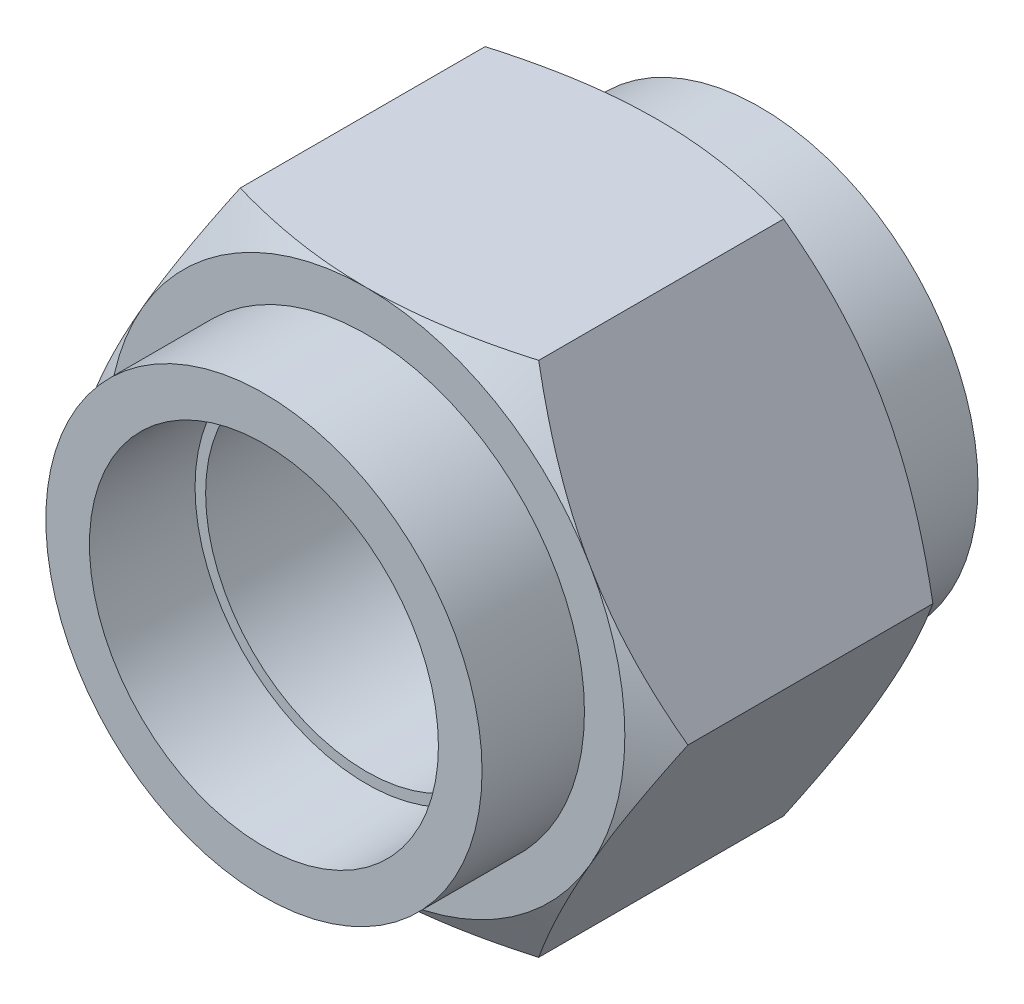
ISO-10303-21;
HEADER;
FILE_DESCRIPTION(('STEP AP214'),'2;1');
FILE_NAME('part.step','',(''),(''),'','','');
FILE_SCHEMA(('AUTOMOTIVE_DESIGN { 1 0 10303 214 1 1 1 1 }'));
ENDSEC;
DATA;
#1=APPLICATION_CONTEXT('core data for automotive mechanical design processes');
#2=APPLICATION_PROTOCOL_DEFINITION('international standard','automotive_design',2000,#1);
#3=PRODUCT_CONTEXT('',#1,'mechanical');
#4=PRODUCT('Part','Part','',(#3));
#5=PRODUCT_RELATED_PRODUCT_CATEGORY('part','',(#4));
#6=PRODUCT_DEFINITION_FORMATION('','',#4);
#7=PRODUCT_DEFINITION_CONTEXT('part definition',#1,'design');
#8=PRODUCT_DEFINITION('design','',#6,#7);
#9=PRODUCT_DEFINITION_SHAPE('','',#8);
#10=(LENGTH_UNIT() NAMED_UNIT(*) SI_UNIT(.MILLI.,.METRE.));
#11=(NAMED_UNIT(*) PLANE_ANGLE_UNIT() SI_UNIT($,.RADIAN.));
#12=(NAMED_UNIT(*) SI_UNIT($,.STERADIAN.) SOLID_ANGLE_UNIT());
#13=UNCERTAINTY_MEASURE_WITH_UNIT(LENGTH_MEASURE(1.E-05),#10,'distance_accuracy_value','');
#14=(GEOMETRIC_REPRESENTATION_CONTEXT(3) GLOBAL_UNCERTAINTY_ASSIGNED_CONTEXT((#13)) GLOBAL_UNIT_ASSIGNED_CONTEXT((#10,
#11,#12)) REPRESENTATION_CONTEXT('',''));
#15=CARTESIAN_POINT('',(0.,0.,0.));
#16=DIRECTION('',(0.,0.,1.));
#17=DIRECTION('',(1.,0.,0.));
#18=AXIS2_PLACEMENT_3D('',#15,#16,#17);
#19=CARTESIAN_POINT('',(0.,0.,-25.1612399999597));
#20=DIRECTION('',(0.,0.,-1.));
#21=DIRECTION('',(1.,0.,0.));
#22=AXIS2_PLACEMENT_3D('',#19,#20,#21);
#23=PLANE('',#22);
#24=CARTESIAN_POINT('',(0.,0.,-25.1612399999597));
#25=DIRECTION('',(0.,0.,-1.));
#26=DIRECTION('',(-1.,0.,0.));
#27=AXIS2_PLACEMENT_3D('',#24,#25,#26);
#28=CIRCLE('',#27,29.6113696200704);
#29=CARTESIAN_POINT('',(-29.6113696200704,0.,-25.1612399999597));
#30=VERTEX_POINT('',#29);
#31=EDGE_CURVE('E308',#30,#30,#28,.F.);
#32=ORIENTED_EDGE('',*,*,#31,.F.);
#33=EDGE_LOOP('',(#32));
#34=FACE_BOUND('',#33,.T.);
#35=CARTESIAN_POINT('',(0.,0.,-25.1612399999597));
#36=DIRECTION('',(0.,0.,-1.));
#37=DIRECTION('',(-1.,0.,0.));
#38=AXIS2_PLACEMENT_3D('',#35,#36,#37);
#39=CIRCLE('',#38,27.78125);
#40=CARTESIAN_POINT('',(-27.78125,0.,-25.1612399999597));
#41=VERTEX_POINT('',#40);
#42=EDGE_CURVE('E301',#41,#41,#39,.F.);
#43=ORIENTED_EDGE('',*,*,#42,.T.);
#44=EDGE_LOOP('',(#43));
#45=FACE_BOUND('',#44,.T.);
#46=ADVANCED_FACE('F34',(#34,#45),#23,.T.);
#47=CARTESIAN_POINT('',(0.,0.,-42.8625));
#48=DIRECTION('',(0.,0.,1.));
#49=DIRECTION('',(1.,0.,0.));
#50=AXIS2_PLACEMENT_3D('',#47,#48,#49);
#51=PLANE('',#50);
#52=CARTESIAN_POINT('',(0.,0.,-42.8625));
#53=DIRECTION('',(0.,0.,1.));
#54=DIRECTION('',(1.,0.,0.));
#55=AXIS2_PLACEMENT_3D('',#52,#53,#54);
#56=CIRCLE('',#55,37.703125);
#57=CARTESIAN_POINT('',(37.703125,0.,-42.8625));
#58=VERTEX_POINT('',#57);
#59=EDGE_CURVE('E380',#58,#58,#56,.T.);
#60=ORIENTED_EDGE('',*,*,#59,.F.);
#61=EDGE_LOOP('',(#60));
#62=FACE_BOUND('',#61,.T.);
#63=CARTESIAN_POINT('',(0.,0.,-42.8624999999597));
#64=DIRECTION('',(0.,0.,1.));
#65=DIRECTION('',(1.,0.,0.));
#66=AXIS2_PLACEMENT_3D('',#63,#64,#65);
#67=CIRCLE('',#66,30.1625);
#68=CARTESIAN_POINT('',(30.1625,0.,-42.8624999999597));
#69=VERTEX_POINT('',#68);
#70=EDGE_CURVE('E303',#69,#69,#67,.T.);
#71=ORIENTED_EDGE('',*,*,#70,.T.);
#72=EDGE_LOOP('',(#71));
#73=FACE_BOUND('',#72,.T.);
#74=ADVANCED_FACE('F371',(#62,#73),#51,.F.);
#75=CARTESIAN_POINT('',(0.,0.,25.16124));
#76=DIRECTION('',(0.,0.,-1.));
#77=DIRECTION('',(-1.,0.,0.));
#78=AXIS2_PLACEMENT_3D('',#75,#76,#77);
#79=PLANE('',#78);
#80=CARTESIAN_POINT('',(0.,0.,25.16124));
#81=DIRECTION('',(0.,0.,1.));
#82=DIRECTION('',(1.,0.,0.));
#83=AXIS2_PLACEMENT_3D('',#80,#81,#82);
#84=CIRCLE('',#83,37.703125);
#85=CARTESIAN_POINT('',(37.703125,0.,25.16124));
#86=VERTEX_POINT('',#85);
#87=EDGE_CURVE('E276',#86,#86,#84,.T.);
#88=ORIENTED_EDGE('',*,*,#87,.F.);
#89=EDGE_LOOP('',(#88));
#90=FACE_BOUND('',#89,.T.);
#91=CARTESIAN_POINT('',(0.,0.,25.16124));
#92=DIRECTION('',(0.,0.,-1.));
#93=DIRECTION('',(-1.,0.,0.));
#94=AXIS2_PLACEMENT_3D('',#91,#92,#93);
#95=CIRCLE('',#94,44.685346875);
#96=CARTESIAN_POINT('',(-38.6986455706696,22.3426734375,25.16124));
#97=VERTEX_POINT('',#96);
#98=CARTESIAN_POINT('',(0.,44.685346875,25.16124));
#99=VERTEX_POINT('',#98);
#100=EDGE_CURVE('E145',#97,#99,#95,.T.);
#101=ORIENTED_EDGE('',*,*,#100,.F.);
#102=CARTESIAN_POINT('',(-38.6986455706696,-22.3426734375,25.16124));
#103=VERTEX_POINT('',#102);
#104=EDGE_CURVE('E283',#103,#97,#95,.T.);
#105=ORIENTED_EDGE('',*,*,#104,.F.);
#106=CARTESIAN_POINT('',(0.,-44.685346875,25.16124));
#107=VERTEX_POINT('',#106);
#108=EDGE_CURVE('E300',#107,#103,#95,.T.);
#109=ORIENTED_EDGE('',*,*,#108,.F.);
#110=CARTESIAN_POINT('',(38.6986455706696,-22.3426734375,25.16124));
#111=VERTEX_POINT('',#110);
#112=EDGE_CURVE('E338',#111,#107,#95,.T.);
#113=ORIENTED_EDGE('',*,*,#112,.F.);
#114=CARTESIAN_POINT('',(38.6986455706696,22.3426734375,25.16124));
#115=VERTEX_POINT('',#114);
#116=EDGE_CURVE('E335',#115,#111,#95,.T.);
#117=ORIENTED_EDGE('',*,*,#116,.F.);
#118=CARTESIAN_POINT('',(0.,0.,25.16124));
#119=DIRECTION('',(0.,0.,1.));
#120=DIRECTION('',(1.,0.,0.));
#121=AXIS2_PLACEMENT_3D('',#118,#119,#120);
#122=CIRCLE('',#121,44.685346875);
#123=EDGE_CURVE('E328',#115,#99,#122,.T.);
#124=ORIENTED_EDGE('',*,*,#123,.T.);
#125=EDGE_LOOP('',(#101,#105,#109,#113,#117,#124));
#126=FACE_BOUND('',#125,.T.);
#127=ADVANCED_FACE('F336',(#90,#126),#79,.F.);
#128=CARTESIAN_POINT('',(0.,0.,25.16124));
#129=DIRECTION('',(0.,0.,1.));
#130=DIRECTION('',(1.,0.,0.));
#131=AXIS2_PLACEMENT_3D('',#128,#129,#130);
#132=CYLINDRICAL_SURFACE('',#131,37.703125);
#133=ORIENTED_EDGE('',*,*,#87,.T.);
#134=EDGE_LOOP('',(#133));
#135=FACE_BOUND('',#134,.T.);
#136=CARTESIAN_POINT('',(0.,0.,42.8625));
#137=DIRECTION('',(0.,0.,1.));
#138=DIRECTION('',(1.,0.,0.));
#139=AXIS2_PLACEMENT_3D('',#136,#137,#138);
#140=CIRCLE('',#139,37.703125);
#141=CARTESIAN_POINT('',(37.703125,0.,42.8625));
#142=VERTEX_POINT('',#141);
#143=EDGE_CURVE('E275',#142,#142,#140,.T.);
#144=ORIENTED_EDGE('',*,*,#143,.F.);
#145=EDGE_LOOP('',(#144));
#146=FACE_BOUND('',#145,.T.);
#147=ADVANCED_FACE('F548',(#135,#146),#132,.T.);
#148=CARTESIAN_POINT('',(0.,0.,42.8625));
#149=DIRECTION('',(0.,0.,1.));
#150=DIRECTION('',(1.,0.,0.));
#151=AXIS2_PLACEMENT_3D('',#148,#149,#150);
#152=PLANE('',#151);
#153=CARTESIAN_POINT('',(0.,0.,42.8624999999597));
#154=DIRECTION('',(0.,0.,1.));
#155=DIRECTION('',(1.,0.,0.));
#156=AXIS2_PLACEMENT_3D('',#153,#154,#155);
#157=CIRCLE('',#156,30.1625);
#158=CARTESIAN_POINT('',(30.1625,0.,42.8624999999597));
#159=VERTEX_POINT('',#158);
#160=EDGE_CURVE('E268',#159,#159,#157,.T.);
#161=ORIENTED_EDGE('',*,*,#160,.F.);
#162=EDGE_LOOP('',(#161));
#163=FACE_BOUND('',#162,.T.);
#164=ORIENTED_EDGE('',*,*,#143,.T.);
#165=EDGE_LOOP('',(#164));
#166=FACE_BOUND('',#165,.T.);
#167=ADVANCED_FACE('F567',(#163,#166),#152,.T.);
#168=CARTESIAN_POINT('',(0.,0.,42.8624999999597));
#169=DIRECTION('',(0.,0.,1.));
#170=DIRECTION('',(1.,0.,0.));
#171=AXIS2_PLACEMENT_3D('',#168,#169,#170);
#172=CONICAL_SURFACE('',#171,30.1625,0.0311250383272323);
#173=CARTESIAN_POINT('',(0.,0.,25.1612399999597));
#174=DIRECTION('',(0.,0.,1.));
#175=DIRECTION('',(1.,0.,0.));
#176=AXIS2_PLACEMENT_3D('',#173,#174,#175);
#177=CIRCLE('',#176,29.6113696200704);
#178=CARTESIAN_POINT('',(29.6113696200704,0.,25.1612399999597));
#179=VERTEX_POINT('',#178);
#180=EDGE_CURVE('E271',#179,#179,#177,.T.);
#181=ORIENTED_EDGE('',*,*,#180,.F.);
#182=EDGE_LOOP('',(#181));
#183=FACE_BOUND('',#182,.T.);
#184=ORIENTED_EDGE('',*,*,#160,.T.);
#185=EDGE_LOOP('',(#184));
#186=FACE_BOUND('',#185,.T.);
#187=ADVANCED_FACE('F558',(#183,#186),#172,.F.);
#188=CARTESIAN_POINT('',(0.,0.,25.1612399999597));
#189=DIRECTION('',(0.,0.,1.));
#190=DIRECTION('',(1.,0.,0.));
#191=AXIS2_PLACEMENT_3D('',#188,#189,#190);
#192=PLANE('',#191);
#193=CARTESIAN_POINT('',(0.,0.,25.1612399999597));
#194=DIRECTION('',(0.,0.,1.));
#195=DIRECTION('',(1.,0.,0.));
#196=AXIS2_PLACEMENT_3D('',#193,#194,#195);
#197=CIRCLE('',#196,27.78125);
#198=CARTESIAN_POINT('',(27.78125,0.,25.1612399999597));
#199=VERTEX_POINT('',#198);
#200=EDGE_CURVE('E272',#199,#199,#197,.T.);
#201=ORIENTED_EDGE('',*,*,#200,.F.);
#202=EDGE_LOOP('',(#201));
#203=FACE_BOUND('',#202,.T.);
#204=ORIENTED_EDGE('',*,*,#180,.T.);
#205=EDGE_LOOP('',(#204));
#206=FACE_BOUND('',#205,.T.);
#207=ADVANCED_FACE('F441',(#203,#206),#192,.T.);
#208=CARTESIAN_POINT('',(0.,0.,0.));
#209=DIRECTION('',(0.,0.,1.));
#210=DIRECTION('',(1.,0.,0.));
#211=AXIS2_PLACEMENT_3D('',#208,#209,#210);
#212=CYLINDRICAL_SURFACE('',#211,27.78125);
#213=ORIENTED_EDGE('',*,*,#200,.T.);
#214=EDGE_LOOP('',(#213));
#215=FACE_BOUND('',#214,.T.);
#216=ORIENTED_EDGE('',*,*,#42,.F.);
#217=EDGE_LOOP('',(#216));
#218=FACE_BOUND('',#217,.T.);
#219=ADVANCED_FACE('F241',(#215,#218),#212,.F.);
#220=CARTESIAN_POINT('',(0.,0.,25.16124));
#221=DIRECTION('',(0.,0.,-1.));
#222=DIRECTION('',(1.,0.,0.));
#223=AXIS2_PLACEMENT_3D('',#220,#221,#222);
#224=CONICAL_SURFACE('',#223,44.685346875,1.0471975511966);
#225=CARTESIAN_POINT('',(-51.5983095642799,0.000199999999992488,21.1700391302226));
#226=CARTESIAN_POINT('',(-51.0312574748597,-0.981963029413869,21.4974010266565));
#227=CARTESIAN_POINT('',(-50.461993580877,-1.96795701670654,21.8099074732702));
#228=CARTESIAN_POINT('',(-49.3189009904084,-3.94785146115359,22.4010802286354));
#229=CARTESIAN_POINT('',(-48.7450708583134,-4.94175440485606,22.6797354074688));
#230=CARTESIAN_POINT('',(-47.5917245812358,-6.93940875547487,23.199465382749));
#231=CARTESIAN_POINT('',(-47.0121982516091,-7.94317780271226,23.4404504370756));
#232=CARTESIAN_POINT('',(-45.8491433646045,-9.95764795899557,23.8796487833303));
#233=CARTESIAN_POINT('',(-45.2656152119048,-10.9683483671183,24.0778663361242));
#234=CARTESIAN_POINT('',(-44.1094720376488,-12.9708470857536,24.4231156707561));
#235=CARTESIAN_POINT('',(-43.5369427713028,-13.9624968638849,24.5712892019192));
#236=CARTESIAN_POINT('',(-42.3892609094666,-15.9503401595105,24.8197415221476));
#237=CARTESIAN_POINT('',(-41.8141082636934,-16.9465337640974,24.920019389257));
#238=CARTESIAN_POINT('',(-40.6628369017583,-18.940594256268,25.0701484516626));
#239=CARTESIAN_POINT('',(-40.0867201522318,-19.9384577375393,25.1200595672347));
#240=CARTESIAN_POINT('',(-38.9339549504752,-21.9351056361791,25.1683816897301));
#241=CARTESIAN_POINT('',(-38.3573065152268,-22.9338900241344,25.1667942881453));
#242=CARTESIAN_POINT('',(-37.2792602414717,-24.8011209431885,25.1157174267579));
#243=CARTESIAN_POINT('',(-36.7777855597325,-25.6697005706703,25.0724563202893));
#244=CARTESIAN_POINT('',(-35.7760321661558,-27.4047883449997,24.9478072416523));
#245=CARTESIAN_POINT('',(-35.2757534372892,-28.2712965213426,24.866419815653));
#246=CARTESIAN_POINT('',(-34.2765826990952,-30.0019110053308,24.6669333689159));
#247=CARTESIAN_POINT('',(-33.7776923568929,-30.8660144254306,24.5488011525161));
#248=CARTESIAN_POINT('',(-32.7822829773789,-32.5901140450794,24.2778979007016));
#249=CARTESIAN_POINT('',(-32.285763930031,-33.4501102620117,24.1251270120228));
#250=CARTESIAN_POINT('',(-31.2845558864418,-35.1842534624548,23.7836317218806));
#251=CARTESIAN_POINT('',(-30.7799284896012,-36.0582937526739,23.594188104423));
#252=CARTESIAN_POINT('',(-29.7737622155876,-37.8010248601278,23.1844016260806));
#253=CARTESIAN_POINT('',(-29.2722237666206,-38.669714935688,22.9640545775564));
#254=CARTESIAN_POINT('',(-28.2734114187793,-40.3997086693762,22.4957957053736));
#255=CARTESIAN_POINT('',(-27.7761311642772,-41.2610233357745,22.2479378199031));
#256=CARTESIAN_POINT('',(-26.7850100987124,-42.9776953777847,21.727129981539));
#257=CARTESIAN_POINT('',(-26.2911683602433,-43.8330543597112,21.4541871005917));
#258=CARTESIAN_POINT('',(-25.7989815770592,-44.685546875,21.1700391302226));
#259=B_SPLINE_CURVE_WITH_KNOTS('',3,(#225,#226,#227,#228,#229,#230,#231,#232,#233,#234,#235,
#236,#237,#238,#239,#240,#241,#242,#243,#244,#245,#246,#247,#248,#249,#250,#251,#252,#253,#254,
#255,#256,#257,#258),.UNSPECIFIED.,.F.,.F.,(4,2,2,2,2,2,2,2,2,2,2,2,2,2,2,2,4),(0.,
3.54131036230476,7.08378193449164,10.6345682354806,14.1850006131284,17.6478752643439,
21.1108165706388,24.5696332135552,28.0283429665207,31.0392632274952,34.0501403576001,
37.0637454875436,40.0773378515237,43.1574540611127,46.2379880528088,49.3125855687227,
52.3863189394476),.UNSPECIFIED.);
#260=CARTESIAN_POINT('',(-51.5981940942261,0.,21.1701057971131));
#261=VERTEX_POINT('',#260);
#262=EDGE_CURVE('E224',#261,#103,#259,.T.);
#263=ORIENTED_EDGE('',*,*,#262,.T.);
#264=ORIENTED_EDGE('',*,*,#104,.T.);
#265=CARTESIAN_POINT('',(-51.5983095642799,-0.000200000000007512,21.1700391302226));
#266=CARTESIAN_POINT('',(-51.0312574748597,0.981963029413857,21.4974010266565));
#267=CARTESIAN_POINT('',(-50.461993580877,1.96795701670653,21.8099074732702));
#268=CARTESIAN_POINT('',(-49.3189009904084,3.94785146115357,22.4010802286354));
#269=CARTESIAN_POINT('',(-48.7450708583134,4.94175440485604,22.6797354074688));
#270=CARTESIAN_POINT('',(-47.5917245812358,6.93940875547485,23.199465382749));
#271=CARTESIAN_POINT('',(-47.0121982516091,7.94317780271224,23.4404504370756));
#272=CARTESIAN_POINT('',(-45.8491433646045,9.95764795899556,23.8796487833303));
#273=CARTESIAN_POINT('',(-45.2656152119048,10.9683483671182,24.0778663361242));
#274=CARTESIAN_POINT('',(-44.1094720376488,12.9708470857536,24.4231156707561));
#275=CARTESIAN_POINT('',(-43.5369427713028,13.9624968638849,24.5712892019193));
#276=CARTESIAN_POINT('',(-42.3892609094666,15.9503401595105,24.8197415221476));
#277=CARTESIAN_POINT('',(-41.8141082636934,16.9465337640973,24.9200193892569));
#278=CARTESIAN_POINT('',(-40.6628369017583,18.940594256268,25.0701484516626));
#279=CARTESIAN_POINT('',(-40.0867201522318,19.9384577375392,25.1200595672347));
#280=CARTESIAN_POINT('',(-38.9339549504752,21.935105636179,25.1683816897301));
#281=CARTESIAN_POINT('',(-38.3573065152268,22.9338900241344,25.1667942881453));
#282=CARTESIAN_POINT('',(-37.2792602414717,24.8011209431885,25.1157174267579));
#283=CARTESIAN_POINT('',(-36.7777855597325,25.6697005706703,25.0724563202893));
#284=CARTESIAN_POINT('',(-35.7760321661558,27.4047883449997,24.9478072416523));
#285=CARTESIAN_POINT('',(-35.2757534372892,28.2712965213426,24.866419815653));
#286=CARTESIAN_POINT('',(-34.2765826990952,30.0019110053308,24.6669333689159));
#287=CARTESIAN_POINT('',(-33.7776923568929,30.8660144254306,24.5488011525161));
#288=CARTESIAN_POINT('',(-32.7822829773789,32.5901140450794,24.2778979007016));
#289=CARTESIAN_POINT('',(-32.285763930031,33.4501102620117,24.1251270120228));
#290=CARTESIAN_POINT('',(-31.2845558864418,35.1842534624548,23.7836317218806));
#291=CARTESIAN_POINT('',(-30.7799284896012,36.0582937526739,23.594188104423));
#292=CARTESIAN_POINT('',(-29.7737622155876,37.8010248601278,23.1844016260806));
#293=CARTESIAN_POINT('',(-29.2722237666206,38.669714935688,22.9640545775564));
#294=CARTESIAN_POINT('',(-28.2734114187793,40.3997086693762,22.4957957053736));
#295=CARTESIAN_POINT('',(-27.7761311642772,41.2610233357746,22.2479378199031));
#296=CARTESIAN_POINT('',(-26.7850100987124,42.9776953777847,21.727129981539));
#297=CARTESIAN_POINT('',(-26.2911683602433,43.8330543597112,21.4541871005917));
#298=CARTESIAN_POINT('',(-25.7989815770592,44.685546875,21.1700391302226));
#299=B_SPLINE_CURVE_WITH_KNOTS('',3,(#265,#266,#267,#268,#269,#270,#271,#272,#273,#274,#275,
#276,#277,#278,#279,#280,#281,#282,#283,#284,#285,#286,#287,#288,#289,#290,#291,#292,#293,#294,
#295,#296,#297,#298),.UNSPECIFIED.,.F.,.F.,(4,2,2,2,2,2,2,2,2,2,2,2,2,2,2,2,4),(0.,
3.54131036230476,7.08378193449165,10.6345682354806,14.1850006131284,17.6478752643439,
21.1108165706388,24.5696332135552,28.0283429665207,31.0392632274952,34.0501403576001,
37.0637454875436,40.0773378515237,43.1574540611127,46.2379880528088,49.3125855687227,
52.3863189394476),.UNSPECIFIED.);
#300=EDGE_CURVE('E215',#261,#97,#299,.T.);
#301=ORIENTED_EDGE('',*,*,#300,.F.);
#302=EDGE_LOOP('',(#263,#264,#301));
#303=FACE_BOUND('',#302,.T.);
#304=ADVANCED_FACE('F235',(#303),#224,.T.);
#305=CARTESIAN_POINT('',(-25.7990970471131,-44.685346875,21.1701057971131));
#306=VERTEX_POINT('',#305);
#307=EDGE_CURVE('E226',#103,#306,#259,.T.);
#308=ORIENTED_EDGE('',*,*,#307,.T.);
#309=CARTESIAN_POINT('',(-68.7507287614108,-44.685346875,3.61957613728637));
#310=CARTESIAN_POINT('',(-67.7771879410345,-44.685346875,4.09083745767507));
#311=CARTESIAN_POINT('',(-66.8024889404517,-44.685346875,4.55971432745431));
#312=CARTESIAN_POINT('',(-64.850534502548,-44.685346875,5.4921411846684));
#313=CARTESIAN_POINT('',(-63.8732790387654,-44.685346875,5.95569111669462));
#314=CARTESIAN_POINT('',(-61.9158360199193,-44.685346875,6.87696962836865));
#315=CARTESIAN_POINT('',(-60.9356480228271,-44.685346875,7.33469726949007));
#316=CARTESIAN_POINT('',(-58.9722366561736,-44.685346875,8.24359304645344));
#317=CARTESIAN_POINT('',(-57.9890132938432,-44.685346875,8.69476119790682));
#318=CARTESIAN_POINT('',(-56.0137337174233,-44.685346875,9.59229283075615));
#319=CARTESIAN_POINT('',(-55.0216588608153,-44.685346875,10.0386153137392));
#320=CARTESIAN_POINT('',(-53.0338326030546,-44.685346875,10.9229947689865));
#321=CARTESIAN_POINT('',(-52.0380812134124,-44.685346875,11.3610517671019));
#322=CARTESIAN_POINT('',(-50.0425916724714,-44.685346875,12.2278818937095));
#323=CARTESIAN_POINT('',(-49.0428536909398,-44.685346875,12.6566554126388));
#324=CARTESIAN_POINT('',(-47.0389698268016,-44.685346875,13.5037878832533));
#325=CARTESIAN_POINT('',(-46.0348239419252,-44.685346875,13.9221468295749));
#326=CARTESIAN_POINT('',(-43.9904681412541,-44.685346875,14.759936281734));
#327=CARTESIAN_POINT('',(-42.9501063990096,-44.685346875,15.1789968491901));
#328=CARTESIAN_POINT('',(-40.8637880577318,-44.685346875,16.002980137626));
#329=CARTESIAN_POINT('',(-39.8178314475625,-44.685346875,16.4079028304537));
#330=CARTESIAN_POINT('',(-37.7196970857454,-44.685346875,17.2017442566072));
#331=CARTESIAN_POINT('',(-36.6675185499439,-44.685346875,17.5906609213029));
#332=CARTESIAN_POINT('',(-34.5565816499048,-44.685346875,18.3502350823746));
#333=CARTESIAN_POINT('',(-33.4978233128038,-44.685346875,18.7208926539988));
#334=CARTESIAN_POINT('',(-31.3754841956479,-44.685346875,19.4406855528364));
#335=CARTESIAN_POINT('',(-30.3119182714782,-44.685346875,19.7898645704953));
#336=CARTESIAN_POINT('',(-28.1773195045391,-44.685346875,20.4647414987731));
#337=CARTESIAN_POINT('',(-27.1062865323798,-44.685346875,20.7904390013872));
#338=CARTESIAN_POINT('',(-24.956754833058,-44.685346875,21.415130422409));
#339=CARTESIAN_POINT('',(-23.8782582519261,-44.685346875,21.7141316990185));
#340=CARTESIAN_POINT('',(-21.7133959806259,-44.685346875,22.2821093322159));
#341=CARTESIAN_POINT('',(-20.6270305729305,-44.685346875,22.551086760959));
#342=CARTESIAN_POINT('',(-18.4522895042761,-44.685346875,23.0540651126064));
#343=CARTESIAN_POINT('',(-17.3639553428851,-44.685346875,23.2882446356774));
#344=CARTESIAN_POINT('',(-15.1799784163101,-44.685346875,23.7196849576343));
#345=CARTESIAN_POINT('',(-14.0843358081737,-44.685346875,23.9169465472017));
#346=CARTESIAN_POINT('',(-11.886526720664,-44.685346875,24.2710354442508));
#347=CARTESIAN_POINT('',(-10.784360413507,-44.685346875,24.4278638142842));
#348=CARTESIAN_POINT('',(-8.57466576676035,-44.685346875,24.6979469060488));
#349=CARTESIAN_POINT('',(-7.46713742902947,-44.685346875,24.8112016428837));
#350=CARTESIAN_POINT('',(-5.26254198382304,-44.685346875,24.9904885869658));
#351=CARTESIAN_POINT('',(-4.16552290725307,-44.685346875,25.0571078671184));
#352=CARTESIAN_POINT('',(-1.96965212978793,-44.685346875,25.1439333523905));
#353=CARTESIAN_POINT('',(-0.870800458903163,-44.685346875,25.1641403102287));
#354=CARTESIAN_POINT('',(1.32676952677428,-44.685346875,25.1576681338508));
#355=CARTESIAN_POINT('',(2.42548784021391,-44.685346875,25.1309885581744));
#356=CARTESIAN_POINT('',(4.62087598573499,-44.685346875,25.0313620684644));
#357=CARTESIAN_POINT('',(5.7175457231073,-44.685346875,24.9584130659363));
#358=CARTESIAN_POINT('',(7.59113639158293,-44.685346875,24.7953977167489));
#359=CARTESIAN_POINT('',(8.36903713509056,-44.685346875,24.7163394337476));
#360=CARTESIAN_POINT('',(9.92233580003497,-44.685346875,24.5365227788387));
#361=CARTESIAN_POINT('',(10.6977336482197,-44.685346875,24.435763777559));
#362=CARTESIAN_POINT('',(13.019589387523,-44.685346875,24.1024164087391));
#363=CARTESIAN_POINT('',(14.5616629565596,-44.685346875,23.8387618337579));
#364=CARTESIAN_POINT('',(17.6324636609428,-44.685346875,23.2379436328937));
#365=CARTESIAN_POINT('',(19.161179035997,-44.685346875,22.9007209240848));
#366=CARTESIAN_POINT('',(22.2031319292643,-44.685346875,22.1630359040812));
#367=CARTESIAN_POINT('',(23.7163697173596,-44.685346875,21.7625746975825));
#368=CARTESIAN_POINT('',(26.7601623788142,-44.685346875,20.8987812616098));
#369=CARTESIAN_POINT('',(28.2903813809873,-44.685346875,20.4342741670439));
#370=CARTESIAN_POINT('',(31.3357399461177,-44.685346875,19.458462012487));
#371=CARTESIAN_POINT('',(32.8508794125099,-44.685346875,18.9471566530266));
#372=CARTESIAN_POINT('',(35.8668594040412,-44.685346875,17.8857599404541));
#373=CARTESIAN_POINT('',(37.3677047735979,-44.685346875,17.3356823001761));
#374=CARTESIAN_POINT('',(39.6096862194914,-44.685346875,16.4862394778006));
#375=CARTESIAN_POINT('',(40.3554660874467,-44.685346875,16.199037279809));
#376=CARTESIAN_POINT('',(41.8441277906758,-44.685346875,15.6172048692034));
#377=CARTESIAN_POINT('',(42.5870096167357,-44.685346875,15.322574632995));
#378=CARTESIAN_POINT('',(44.2858176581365,-44.685346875,14.6398130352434));
#379=CARTESIAN_POINT('',(45.2408351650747,-44.685346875,14.249421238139));
#380=CARTESIAN_POINT('',(47.146688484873,-44.685346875,13.4585508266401));
#381=CARTESIAN_POINT('',(48.0975242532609,-44.685346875,13.0580721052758));
#382=CARTESIAN_POINT('',(50.9443435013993,-44.685346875,11.8431215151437));
#383=CARTESIAN_POINT('',(52.834577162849,-44.685346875,11.0151602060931));
#384=CARTESIAN_POINT('',(56.6024422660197,-44.685346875,9.3302273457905));
#385=CARTESIAN_POINT('',(58.4800712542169,-44.685346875,8.47325033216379));
#386=CARTESIAN_POINT('',(62.2243940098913,-44.685346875,6.73585429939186));
#387=CARTESIAN_POINT('',(64.0910879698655,-44.685346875,5.85543569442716));
#388=CARTESIAN_POINT('',(67.8170767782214,-44.685346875,4.07450548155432));
#389=CARTESIAN_POINT('',(69.6763626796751,-44.685346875,3.17397518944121));
#390=CARTESIAN_POINT('',(73.3871223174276,-44.685346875,1.35696357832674));
#391=CARTESIAN_POINT('',(75.2385960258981,-44.685346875,0.440482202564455));
#392=CARTESIAN_POINT('',(78.9346853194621,-44.685346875,-1.40570215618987));
#393=CARTESIAN_POINT('',(80.779301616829,-44.685346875,-2.3354037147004));
#394=CARTESIAN_POINT('',(84.4628294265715,-44.685346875,-4.20602428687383));
#395=CARTESIAN_POINT('',(86.3017409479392,-44.685346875,-5.14694328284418));
#396=CARTESIAN_POINT('',(89.8300451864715,-44.685346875,-6.96384414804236));
#397=CARTESIAN_POINT('',(91.5198093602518,-44.685346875,-7.83910522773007));
#398=CARTESIAN_POINT('',(94.8956890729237,-44.685346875,-9.59663226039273));
#399=CARTESIAN_POINT('',(96.5818046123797,-44.685346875,-10.4788982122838));
#400=CARTESIAN_POINT('',(99.950877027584,-44.685346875,-12.2495563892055));
#401=CARTESIAN_POINT('',(101.633833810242,-44.685346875,-13.137948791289));
#402=CARTESIAN_POINT('',(104.996915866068,-44.685346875,-14.9200774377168));
#403=CARTESIAN_POINT('',(106.677041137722,-44.685346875,-15.813813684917));
#404=CARTESIAN_POINT('',(110.031006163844,-44.685346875,-17.6039751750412));
#405=CARTESIAN_POINT('',(111.704851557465,-44.685346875,-18.5003898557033));
#406=CARTESIAN_POINT('',(115.050316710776,-44.685346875,-20.2973632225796));
#407=CARTESIAN_POINT('',(116.721936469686,-44.685346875,-21.1979219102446));
#408=CARTESIAN_POINT('',(120.06310501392,-44.685346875,-23.0026741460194));
#409=CARTESIAN_POINT('',(121.73265389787,-44.685346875,-23.9068675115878));
#410=CARTESIAN_POINT('',(125.069960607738,-44.685346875,-25.7185475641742));
#411=CARTESIAN_POINT('',(126.737718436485,-44.685346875,-26.6260342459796));
#412=CARTESIAN_POINT('',(128.404681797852,-44.685346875,-27.5349760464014));
#413=B_SPLINE_CURVE_WITH_KNOTS('',3,(#309,#310,#311,#312,#313,#314,#315,#316,#317,#318,#319,
#320,#321,#322,#323,#324,#325,#326,#327,#328,#329,#330,#331,#332,#333,#334,#335,#336,#337,#338,
#339,#340,#341,#342,#343,#344,#345,#346,#347,#348,#349,#350,#351,#352,#353,#354,#355,#356,#357,
#358,#359,#360,#361,#362,#363,#364,#365,#366,#367,#368,#369,#370,#371,#372,#373,#374,#375,#376,
#377,#378,#379,#380,#381,#382,#383,#384,#385,#386,#387,#388,#389,#390,#391,#392,#393,#394,#395,
#396,#397,#398,#399,#400,#401,#402,#403,#404,#405,#406,#407,#408,#409,#410,#411,#412),
.UNSPECIFIED.,.F.,.F.,(4,2,2,2,2,2,2,2,2,2,2,2,2,2,2,2,2,2,2,2,2,2,2,2,2,2,2,2,2,2,2,2,2,2,2,2,
2,2,2,2,2,2,2,2,2,2,2,2,2,2,2,4),(0.,3.24481643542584,6.48966659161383,9.73503333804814,
12.9803923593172,16.2439068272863,19.5074110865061,22.7707778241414,26.0341462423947,
29.3988251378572,32.7635107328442,36.12862982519,39.4937350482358,42.8517519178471,
46.2098271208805,49.5669738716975,52.9240007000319,56.2631537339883,59.6022352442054,
62.9412289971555,66.2802215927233,69.5763861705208,72.8724972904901,76.1686394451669,
79.4649303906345,81.8103527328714,84.1558431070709,88.8469637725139,93.5418658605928,
98.236685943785,103.033294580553,107.829933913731,112.62488522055,115.022364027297,
117.419850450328,120.514968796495,123.610119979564,129.800622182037,135.992296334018,
142.183861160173,148.381439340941,154.57903957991,160.775977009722,166.972904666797,
172.681867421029,178.390829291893,184.099956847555,189.809087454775,195.505383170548,
201.201680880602,206.897695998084,212.593702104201),.UNSPECIFIED.);
#414=EDGE_CURVE('E347',#306,#107,#413,.T.);
#415=ORIENTED_EDGE('',*,*,#414,.T.);
#416=ORIENTED_EDGE('',*,*,#108,.T.);
#417=EDGE_LOOP('',(#308,#415,#416));
#418=FACE_BOUND('',#417,.T.);
#419=ADVANCED_FACE('F240',(#418),#224,.T.);
#420=ORIENTED_EDGE('',*,*,#112,.T.);
#421=CARTESIAN_POINT('',(25.7990970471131,-44.685346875,21.1701057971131));
#422=VERTEX_POINT('',#421);
#423=EDGE_CURVE('E248',#107,#422,#413,.T.);
#424=ORIENTED_EDGE('',*,*,#423,.T.);
#425=CARTESIAN_POINT('',(51.5983095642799,0.0002,21.1700391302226));
#426=CARTESIAN_POINT('',(51.0312574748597,-0.981963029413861,21.4974010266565));
#427=CARTESIAN_POINT('',(50.461993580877,-1.96795701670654,21.8099074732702));
#428=CARTESIAN_POINT('',(49.3189009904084,-3.94785146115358,22.4010802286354));
#429=CARTESIAN_POINT('',(48.7450708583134,-4.94175440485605,22.6797354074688));
#430=CARTESIAN_POINT('',(47.5917245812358,-6.93940875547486,23.199465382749));
#431=CARTESIAN_POINT('',(47.0121982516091,-7.94317780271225,23.4404504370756));
#432=CARTESIAN_POINT('',(45.8491433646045,-9.95764795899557,23.8796487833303));
#433=CARTESIAN_POINT('',(45.2656152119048,-10.9683483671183,24.0778663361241));
#434=CARTESIAN_POINT('',(44.1094720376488,-12.9708470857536,24.4231156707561));
#435=CARTESIAN_POINT('',(43.5369427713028,-13.9624968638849,24.5712892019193));
#436=CARTESIAN_POINT('',(42.3892609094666,-15.9503401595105,24.8197415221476));
#437=CARTESIAN_POINT('',(41.8141082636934,-16.9465337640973,24.920019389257));
#438=CARTESIAN_POINT('',(40.6628369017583,-18.940594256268,25.0701484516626));
#439=CARTESIAN_POINT('',(40.0867201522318,-19.9384577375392,25.1200595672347));
#440=CARTESIAN_POINT('',(38.9339549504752,-21.935105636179,25.16838168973));
#441=CARTESIAN_POINT('',(38.3573065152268,-22.9338900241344,25.1667942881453));
#442=CARTESIAN_POINT('',(37.2792602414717,-24.8011209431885,25.1157174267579));
#443=CARTESIAN_POINT('',(36.7777855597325,-25.6697005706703,25.0724563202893));
#444=CARTESIAN_POINT('',(35.7760321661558,-27.4047883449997,24.9478072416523));
#445=CARTESIAN_POINT('',(35.2757534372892,-28.2712965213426,24.866419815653));
#446=CARTESIAN_POINT('',(34.2765826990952,-30.0019110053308,24.6669333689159));
#447=CARTESIAN_POINT('',(33.7776923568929,-30.8660144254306,24.5488011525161));
#448=CARTESIAN_POINT('',(32.7822829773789,-32.5901140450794,24.2778979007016));
#449=CARTESIAN_POINT('',(32.285763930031,-33.4501102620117,24.1251270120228));
#450=CARTESIAN_POINT('',(31.2845558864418,-35.1842534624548,23.7836317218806));
#451=CARTESIAN_POINT('',(30.7799284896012,-36.0582937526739,23.594188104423));
#452=CARTESIAN_POINT('',(29.7737622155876,-37.8010248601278,23.1844016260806));
#453=CARTESIAN_POINT('',(29.2722237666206,-38.669714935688,22.9640545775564));
#454=CARTESIAN_POINT('',(28.2734114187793,-40.3997086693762,22.4957957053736));
#455=CARTESIAN_POINT('',(27.7761311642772,-41.2610233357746,22.2479378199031));
#456=CARTESIAN_POINT('',(26.7850100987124,-42.9776953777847,21.727129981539));
#457=CARTESIAN_POINT('',(26.2911683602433,-43.8330543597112,21.4541871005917));
#458=CARTESIAN_POINT('',(25.7989815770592,-44.685546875,21.1700391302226));
#459=B_SPLINE_CURVE_WITH_KNOTS('',3,(#425,#426,#427,#428,#429,#430,#431,#432,#433,#434,#435,
#436,#437,#438,#439,#440,#441,#442,#443,#444,#445,#446,#447,#448,#449,#450,#451,#452,#453,#454,
#455,#456,#457,#458),.UNSPECIFIED.,.F.,.F.,(4,2,2,2,2,2,2,2,2,2,2,2,2,2,2,2,4),(0.,
3.54131036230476,7.08378193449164,10.6345682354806,14.1850006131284,17.6478752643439,
21.1108165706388,24.5696332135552,28.0283429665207,31.0392632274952,34.0501403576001,
37.0637454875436,40.0773378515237,43.1574540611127,46.2379880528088,49.3125855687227,
52.3863189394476),.UNSPECIFIED.);
#460=EDGE_CURVE('E223',#111,#422,#459,.T.);
#461=ORIENTED_EDGE('',*,*,#460,.F.);
#462=EDGE_LOOP('',(#420,#424,#461));
#463=FACE_BOUND('',#462,.T.);
#464=ADVANCED_FACE('F352',(#463),#224,.T.);
#465=CARTESIAN_POINT('',(51.5983095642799,-0.0002,21.1700391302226));
#466=CARTESIAN_POINT('',(51.0312574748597,0.981963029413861,21.4974010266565));
#467=CARTESIAN_POINT('',(50.461993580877,1.96795701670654,21.8099074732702));
#468=CARTESIAN_POINT('',(49.3189009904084,3.94785146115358,22.4010802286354));
#469=CARTESIAN_POINT('',(48.7450708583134,4.94175440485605,22.6797354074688));
#470=CARTESIAN_POINT('',(47.5917245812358,6.93940875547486,23.199465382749));
#471=CARTESIAN_POINT('',(47.0121982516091,7.94317780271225,23.4404504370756));
#472=CARTESIAN_POINT('',(45.8491433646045,9.95764795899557,23.8796487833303));
#473=CARTESIAN_POINT('',(45.2656152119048,10.9683483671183,24.0778663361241));
#474=CARTESIAN_POINT('',(44.1094720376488,12.9708470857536,24.4231156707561));
#475=CARTESIAN_POINT('',(43.5369427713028,13.9624968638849,24.5712892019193));
#476=CARTESIAN_POINT('',(42.3892609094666,15.9503401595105,24.8197415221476));
#477=CARTESIAN_POINT('',(41.8141082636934,16.9465337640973,24.920019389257));
#478=CARTESIAN_POINT('',(40.6628369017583,18.940594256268,25.0701484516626));
#479=CARTESIAN_POINT('',(40.0867201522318,19.9384577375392,25.1200595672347));
#480=CARTESIAN_POINT('',(38.9339549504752,21.935105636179,25.16838168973));
#481=CARTESIAN_POINT('',(38.3573065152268,22.9338900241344,25.1667942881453));
#482=CARTESIAN_POINT('',(37.2792602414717,24.8011209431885,25.1157174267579));
#483=CARTESIAN_POINT('',(36.7777855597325,25.6697005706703,25.0724563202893));
#484=CARTESIAN_POINT('',(35.7760321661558,27.4047883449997,24.9478072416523));
#485=CARTESIAN_POINT('',(35.2757534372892,28.2712965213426,24.866419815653));
#486=CARTESIAN_POINT('',(34.2765826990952,30.0019110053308,24.6669333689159));
#487=CARTESIAN_POINT('',(33.7776923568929,30.8660144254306,24.5488011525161));
#488=CARTESIAN_POINT('',(32.7822829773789,32.5901140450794,24.2778979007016));
#489=CARTESIAN_POINT('',(32.285763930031,33.4501102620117,24.1251270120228));
#490=CARTESIAN_POINT('',(31.2845558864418,35.1842534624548,23.7836317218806));
#491=CARTESIAN_POINT('',(30.7799284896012,36.0582937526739,23.594188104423));
#492=CARTESIAN_POINT('',(29.7737622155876,37.8010248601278,23.1844016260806));
#493=CARTESIAN_POINT('',(29.2722237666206,38.669714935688,22.9640545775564));
#494=CARTESIAN_POINT('',(28.2734114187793,40.3997086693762,22.4957957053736));
#495=CARTESIAN_POINT('',(27.7761311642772,41.2610233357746,22.2479378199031));
#496=CARTESIAN_POINT('',(26.7850100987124,42.9776953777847,21.727129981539));
#497=CARTESIAN_POINT('',(26.2911683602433,43.8330543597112,21.4541871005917));
#498=CARTESIAN_POINT('',(25.7989815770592,44.685546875,21.1700391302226));
#499=B_SPLINE_CURVE_WITH_KNOTS('',3,(#465,#466,#467,#468,#469,#470,#471,#472,#473,#474,#475,
#476,#477,#478,#479,#480,#481,#482,#483,#484,#485,#486,#487,#488,#489,#490,#491,#492,#493,#494,
#495,#496,#497,#498),.UNSPECIFIED.,.F.,.F.,(4,2,2,2,2,2,2,2,2,2,2,2,2,2,2,2,4),(0.,
3.54131036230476,7.08378193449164,10.6345682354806,14.1850006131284,17.6478752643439,
21.1108165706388,24.5696332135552,28.0283429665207,31.0392632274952,34.0501403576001,
37.0637454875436,40.0773378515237,43.1574540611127,46.2379880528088,49.3125855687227,
52.3863189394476),.UNSPECIFIED.);
#500=CARTESIAN_POINT('',(51.5981940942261,0.,21.1701057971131));
#501=VERTEX_POINT('',#500);
#502=EDGE_CURVE('E262',#501,#115,#499,.T.);
#503=ORIENTED_EDGE('',*,*,#502,.T.);
#504=ORIENTED_EDGE('',*,*,#116,.T.);
#505=EDGE_CURVE('E357',#501,#111,#459,.T.);
#506=ORIENTED_EDGE('',*,*,#505,.F.);
#507=EDGE_LOOP('',(#503,#504,#506));
#508=FACE_BOUND('',#507,.T.);
#509=ADVANCED_FACE('F481',(#508),#224,.T.);
#510=CARTESIAN_POINT('',(25.7990970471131,44.685346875,21.1701057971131));
#511=VERTEX_POINT('',#510);
#512=EDGE_CURVE('E267',#115,#511,#499,.T.);
#513=ORIENTED_EDGE('',*,*,#512,.T.);
#514=CARTESIAN_POINT('',(-68.7507287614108,44.685346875,3.61957613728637));
#515=CARTESIAN_POINT('',(-67.7771879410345,44.685346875,4.09083745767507));
#516=CARTESIAN_POINT('',(-66.8024889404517,44.685346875,4.55971432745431));
#517=CARTESIAN_POINT('',(-64.850534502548,44.685346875,5.4921411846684));
#518=CARTESIAN_POINT('',(-63.8732790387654,44.685346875,5.95569111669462));
#519=CARTESIAN_POINT('',(-61.9158360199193,44.685346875,6.87696962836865));
#520=CARTESIAN_POINT('',(-60.9356480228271,44.685346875,7.33469726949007));
#521=CARTESIAN_POINT('',(-58.9722366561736,44.685346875,8.24359304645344));
#522=CARTESIAN_POINT('',(-57.9890132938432,44.685346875,8.69476119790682));
#523=CARTESIAN_POINT('',(-56.0137337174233,44.685346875,9.59229283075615));
#524=CARTESIAN_POINT('',(-55.0216588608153,44.685346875,10.0386153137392));
#525=CARTESIAN_POINT('',(-53.0338326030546,44.685346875,10.9229947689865));
#526=CARTESIAN_POINT('',(-52.0380812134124,44.685346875,11.3610517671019));
#527=CARTESIAN_POINT('',(-50.0425916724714,44.685346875,12.2278818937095));
#528=CARTESIAN_POINT('',(-49.0428536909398,44.685346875,12.6566554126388));
#529=CARTESIAN_POINT('',(-47.0389698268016,44.685346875,13.5037878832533));
#530=CARTESIAN_POINT('',(-46.0348239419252,44.685346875,13.9221468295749));
#531=CARTESIAN_POINT('',(-43.9904681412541,44.685346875,14.759936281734));
#532=CARTESIAN_POINT('',(-42.9501063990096,44.685346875,15.1789968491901));
#533=CARTESIAN_POINT('',(-40.8637880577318,44.685346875,16.002980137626));
#534=CARTESIAN_POINT('',(-39.8178314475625,44.685346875,16.4079028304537));
#535=CARTESIAN_POINT('',(-37.7196970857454,44.685346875,17.2017442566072));
#536=CARTESIAN_POINT('',(-36.6675185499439,44.685346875,17.5906609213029));
#537=CARTESIAN_POINT('',(-34.5565816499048,44.685346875,18.3502350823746));
#538=CARTESIAN_POINT('',(-33.4978233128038,44.685346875,18.7208926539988));
#539=CARTESIAN_POINT('',(-31.3754841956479,44.685346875,19.4406855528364));
#540=CARTESIAN_POINT('',(-30.3119182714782,44.685346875,19.7898645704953));
#541=CARTESIAN_POINT('',(-28.1773195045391,44.685346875,20.4647414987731));
#542=CARTESIAN_POINT('',(-27.1062865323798,44.685346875,20.7904390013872));
#543=CARTESIAN_POINT('',(-24.956754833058,44.685346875,21.415130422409));
#544=CARTESIAN_POINT('',(-23.8782582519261,44.685346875,21.7141316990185));
#545=CARTESIAN_POINT('',(-21.7133959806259,44.685346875,22.2821093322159));
#546=CARTESIAN_POINT('',(-20.6270305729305,44.685346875,22.551086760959));
#547=CARTESIAN_POINT('',(-18.4522895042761,44.685346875,23.0540651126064));
#548=CARTESIAN_POINT('',(-17.3639553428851,44.685346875,23.2882446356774));
#549=CARTESIAN_POINT('',(-15.1799784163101,44.685346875,23.7196849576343));
#550=CARTESIAN_POINT('',(-14.0843358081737,44.685346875,23.9169465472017));
#551=CARTESIAN_POINT('',(-11.886526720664,44.685346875,24.2710354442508));
#552=CARTESIAN_POINT('',(-10.784360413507,44.685346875,24.4278638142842));
#553=CARTESIAN_POINT('',(-8.57466576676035,44.685346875,24.6979469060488));
#554=CARTESIAN_POINT('',(-7.46713742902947,44.685346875,24.8112016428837));
#555=CARTESIAN_POINT('',(-5.26254198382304,44.685346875,24.9904885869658));
#556=CARTESIAN_POINT('',(-4.16552290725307,44.685346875,25.0571078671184));
#557=CARTESIAN_POINT('',(-1.96965212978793,44.685346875,25.1439333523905));
#558=CARTESIAN_POINT('',(-0.870800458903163,44.685346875,25.1641403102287));
#559=CARTESIAN_POINT('',(1.32676952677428,44.685346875,25.1576681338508));
#560=CARTESIAN_POINT('',(2.42548784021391,44.685346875,25.1309885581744));
#561=CARTESIAN_POINT('',(4.62087598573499,44.685346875,25.0313620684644));
#562=CARTESIAN_POINT('',(5.7175457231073,44.685346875,24.9584130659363));
#563=CARTESIAN_POINT('',(7.59113639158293,44.685346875,24.7953977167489));
#564=CARTESIAN_POINT('',(8.36903713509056,44.685346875,24.7163394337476));
#565=CARTESIAN_POINT('',(9.92233580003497,44.685346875,24.5365227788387));
#566=CARTESIAN_POINT('',(10.6977336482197,44.685346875,24.435763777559));
#567=CARTESIAN_POINT('',(13.019589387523,44.685346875,24.1024164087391));
#568=CARTESIAN_POINT('',(14.5616629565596,44.685346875,23.8387618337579));
#569=CARTESIAN_POINT('',(17.6324636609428,44.685346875,23.2379436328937));
#570=CARTESIAN_POINT('',(19.161179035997,44.685346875,22.9007209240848));
#571=CARTESIAN_POINT('',(22.2031319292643,44.685346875,22.1630359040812));
#572=CARTESIAN_POINT('',(23.7163697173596,44.685346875,21.7625746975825));
#573=CARTESIAN_POINT('',(26.7601623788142,44.685346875,20.8987812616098));
#574=CARTESIAN_POINT('',(28.2903813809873,44.685346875,20.4342741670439));
#575=CARTESIAN_POINT('',(31.3357399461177,44.685346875,19.458462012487));
#576=CARTESIAN_POINT('',(32.8508794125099,44.685346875,18.9471566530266));
#577=CARTESIAN_POINT('',(35.8668594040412,44.685346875,17.8857599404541));
#578=CARTESIAN_POINT('',(37.3677047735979,44.685346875,17.3356823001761));
#579=CARTESIAN_POINT('',(39.6096862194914,44.685346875,16.4862394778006));
#580=CARTESIAN_POINT('',(40.3554660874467,44.685346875,16.199037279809));
#581=CARTESIAN_POINT('',(41.8441277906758,44.685346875,15.6172048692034));
#582=CARTESIAN_POINT('',(42.5870096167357,44.685346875,15.322574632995));
#583=CARTESIAN_POINT('',(44.2858176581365,44.685346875,14.6398130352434));
#584=CARTESIAN_POINT('',(45.2408351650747,44.685346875,14.249421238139));
#585=CARTESIAN_POINT('',(47.146688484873,44.685346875,13.4585508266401));
#586=CARTESIAN_POINT('',(48.0975242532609,44.685346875,13.0580721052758));
#587=CARTESIAN_POINT('',(50.9443435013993,44.685346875,11.8431215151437));
#588=CARTESIAN_POINT('',(52.834577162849,44.685346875,11.0151602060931));
#589=CARTESIAN_POINT('',(56.6024422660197,44.685346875,9.3302273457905));
#590=CARTESIAN_POINT('',(58.4800712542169,44.685346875,8.47325033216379));
#591=CARTESIAN_POINT('',(62.2243940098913,44.685346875,6.73585429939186));
#592=CARTESIAN_POINT('',(64.0910879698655,44.685346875,5.85543569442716));
#593=CARTESIAN_POINT('',(67.8170767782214,44.685346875,4.07450548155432));
#594=CARTESIAN_POINT('',(69.6763626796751,44.685346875,3.17397518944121));
#595=CARTESIAN_POINT('',(73.3871223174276,44.685346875,1.35696357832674));
#596=CARTESIAN_POINT('',(75.2385960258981,44.685346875,0.440482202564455));
#597=CARTESIAN_POINT('',(78.9346853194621,44.685346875,-1.40570215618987));
#598=CARTESIAN_POINT('',(80.779301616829,44.685346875,-2.3354037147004));
#599=CARTESIAN_POINT('',(84.4628294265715,44.685346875,-4.20602428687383));
#600=CARTESIAN_POINT('',(86.3017409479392,44.685346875,-5.14694328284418));
#601=CARTESIAN_POINT('',(89.8300451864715,44.685346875,-6.96384414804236));
#602=CARTESIAN_POINT('',(91.5198093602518,44.685346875,-7.83910522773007));
#603=CARTESIAN_POINT('',(94.8956890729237,44.685346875,-9.59663226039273));
#604=CARTESIAN_POINT('',(96.5818046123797,44.685346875,-10.4788982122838));
#605=CARTESIAN_POINT('',(99.950877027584,44.685346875,-12.2495563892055));
#606=CARTESIAN_POINT('',(101.633833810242,44.685346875,-13.137948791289));
#607=CARTESIAN_POINT('',(104.996915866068,44.685346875,-14.9200774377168));
#608=CARTESIAN_POINT('',(106.677041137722,44.685346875,-15.813813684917));
#609=CARTESIAN_POINT('',(110.031006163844,44.685346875,-17.6039751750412));
#610=CARTESIAN_POINT('',(111.704851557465,44.685346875,-18.5003898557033));
#611=CARTESIAN_POINT('',(115.050316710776,44.685346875,-20.2973632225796));
#612=CARTESIAN_POINT('',(116.721936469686,44.685346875,-21.1979219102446));
#613=CARTESIAN_POINT('',(120.06310501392,44.685346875,-23.0026741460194));
#614=CARTESIAN_POINT('',(121.73265389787,44.685346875,-23.9068675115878));
#615=CARTESIAN_POINT('',(125.069960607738,44.685346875,-25.7185475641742));
#616=CARTESIAN_POINT('',(126.737718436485,44.685346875,-26.6260342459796));
#617=CARTESIAN_POINT('',(128.404681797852,44.685346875,-27.5349760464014));
#618=B_SPLINE_CURVE_WITH_KNOTS('',3,(#514,#515,#516,#517,#518,#519,#520,#521,#522,#523,#524,
#525,#526,#527,#528,#529,#530,#531,#532,#533,#534,#535,#536,#537,#538,#539,#540,#541,#542,#543,
#544,#545,#546,#547,#548,#549,#550,#551,#552,#553,#554,#555,#556,#557,#558,#559,#560,#561,#562,
#563,#564,#565,#566,#567,#568,#569,#570,#571,#572,#573,#574,#575,#576,#577,#578,#579,#580,#581,
#582,#583,#584,#585,#586,#587,#588,#589,#590,#591,#592,#593,#594,#595,#596,#597,#598,#599,#600,
#601,#602,#603,#604,#605,#606,#607,#608,#609,#610,#611,#612,#613,#614,#615,#616,#617),
.UNSPECIFIED.,.F.,.F.,(4,2,2,2,2,2,2,2,2,2,2,2,2,2,2,2,2,2,2,2,2,2,2,2,2,2,2,2,2,2,2,2,2,2,2,2,
2,2,2,2,2,2,2,2,2,2,2,2,2,2,2,4),(0.,3.24481643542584,6.48966659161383,9.73503333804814,
12.9803923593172,16.2439068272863,19.5074110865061,22.7707778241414,26.0341462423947,
29.3988251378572,32.7635107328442,36.12862982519,39.4937350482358,42.8517519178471,
46.2098271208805,49.5669738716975,52.9240007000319,56.2631537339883,59.6022352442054,
62.9412289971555,66.2802215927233,69.5763861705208,72.8724972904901,76.1686394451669,
79.4649303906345,81.8103527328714,84.1558431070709,88.8469637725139,93.5418658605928,
98.236685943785,103.033294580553,107.829933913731,112.62488522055,115.022364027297,
117.419850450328,120.514968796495,123.610119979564,129.800622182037,135.992296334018,
142.183861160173,148.381439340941,154.57903957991,160.775977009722,166.972904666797,
172.681867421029,178.390829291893,184.099956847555,189.809087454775,195.505383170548,
201.201680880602,206.897695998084,212.593702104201),.UNSPECIFIED.);
#619=EDGE_CURVE('E57',#99,#511,#618,.T.);
#620=ORIENTED_EDGE('',*,*,#619,.F.);
#621=ORIENTED_EDGE('',*,*,#123,.F.);
#622=EDGE_LOOP('',(#513,#620,#621));
#623=FACE_BOUND('',#622,.T.);
#624=ADVANCED_FACE('F243',(#623),#224,.T.);
#625=CARTESIAN_POINT('',(-25.7990970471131,44.685346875,21.1701057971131));
#626=VERTEX_POINT('',#625);
#627=EDGE_CURVE('E225',#97,#626,#299,.T.);
#628=ORIENTED_EDGE('',*,*,#627,.F.);
#629=ORIENTED_EDGE('',*,*,#100,.T.);
#630=EDGE_CURVE('E257',#626,#99,#618,.T.);
#631=ORIENTED_EDGE('',*,*,#630,.F.);
#632=EDGE_LOOP('',(#628,#629,#631));
#633=FACE_BOUND('',#632,.T.);
#634=ADVANCED_FACE('F475',(#633),#224,.T.);
#635=CARTESIAN_POINT('',(-25.7990970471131,-44.685346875,42.8625));
#636=DIRECTION('',(0.,1.,0.));
#637=DIRECTION('',(0.,0.,1.));
#638=AXIS2_PLACEMENT_3D('',#635,#636,#637);
#639=PLANE('',#638);
#640=DIRECTION('',(0.,0.,-1.));
#641=VECTOR('',#640,1.);
#642=CARTESIAN_POINT('',(-25.7990970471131,-44.685346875,42.8625));
#643=LINE('',#642,#641);
#644=CARTESIAN_POINT('',(-25.7990970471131,-44.685346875,-21.1701057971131));
#645=VERTEX_POINT('',#644);
#646=EDGE_CURVE('E292',#306,#645,#643,.T.);
#647=ORIENTED_EDGE('',*,*,#646,.T.);
#648=CARTESIAN_POINT('',(-68.7507287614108,-44.685346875,-3.61957613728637));
#649=CARTESIAN_POINT('',(-67.7771879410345,-44.685346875,-4.09083745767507));
#650=CARTESIAN_POINT('',(-66.8024889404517,-44.685346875,-4.55971432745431));
#651=CARTESIAN_POINT('',(-64.850534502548,-44.685346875,-5.4921411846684));
#652=CARTESIAN_POINT('',(-63.8732790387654,-44.685346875,-5.95569111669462));
#653=CARTESIAN_POINT('',(-61.9158360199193,-44.685346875,-6.87696962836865));
#654=CARTESIAN_POINT('',(-60.9356480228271,-44.685346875,-7.33469726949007));
#655=CARTESIAN_POINT('',(-58.9722366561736,-44.685346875,-8.24359304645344));
#656=CARTESIAN_POINT('',(-57.9890132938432,-44.685346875,-8.69476119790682));
#657=CARTESIAN_POINT('',(-56.0137337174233,-44.685346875,-9.59229283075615));
#658=CARTESIAN_POINT('',(-55.0216588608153,-44.685346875,-10.0386153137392));
#659=CARTESIAN_POINT('',(-53.0338326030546,-44.685346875,-10.9229947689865));
#660=CARTESIAN_POINT('',(-52.0380812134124,-44.685346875,-11.3610517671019));
#661=CARTESIAN_POINT('',(-50.0425916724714,-44.685346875,-12.2278818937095));
#662=CARTESIAN_POINT('',(-49.0428536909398,-44.685346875,-12.6566554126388));
#663=CARTESIAN_POINT('',(-47.0389698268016,-44.685346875,-13.5037878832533));
#664=CARTESIAN_POINT('',(-46.0348239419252,-44.685346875,-13.9221468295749));
#665=CARTESIAN_POINT('',(-43.9904681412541,-44.685346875,-14.759936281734));
#666=CARTESIAN_POINT('',(-42.9501063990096,-44.685346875,-15.1789968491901));
#667=CARTESIAN_POINT('',(-40.8637880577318,-44.685346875,-16.002980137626));
#668=CARTESIAN_POINT('',(-39.8178314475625,-44.685346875,-16.4079028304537));
#669=CARTESIAN_POINT('',(-37.7196970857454,-44.685346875,-17.2017442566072));
#670=CARTESIAN_POINT('',(-36.6675185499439,-44.685346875,-17.5906609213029));
#671=CARTESIAN_POINT('',(-34.5565816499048,-44.685346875,-18.3502350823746));
#672=CARTESIAN_POINT('',(-33.4978233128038,-44.685346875,-18.7208926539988));
#673=CARTESIAN_POINT('',(-31.3754841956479,-44.685346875,-19.4406855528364));
#674=CARTESIAN_POINT('',(-30.3119182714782,-44.685346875,-19.7898645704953));
#675=CARTESIAN_POINT('',(-28.1773195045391,-44.685346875,-20.4647414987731));
#676=CARTESIAN_POINT('',(-27.1062865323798,-44.685346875,-20.7904390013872));
#677=CARTESIAN_POINT('',(-24.956754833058,-44.685346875,-21.415130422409));
#678=CARTESIAN_POINT('',(-23.8782582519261,-44.685346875,-21.7141316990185));
#679=CARTESIAN_POINT('',(-21.7133959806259,-44.685346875,-22.2821093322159));
#680=CARTESIAN_POINT('',(-20.6270305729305,-44.685346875,-22.551086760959));
#681=CARTESIAN_POINT('',(-18.4522895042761,-44.685346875,-23.0540651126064));
#682=CARTESIAN_POINT('',(-17.3639553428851,-44.685346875,-23.2882446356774));
#683=CARTESIAN_POINT('',(-15.1799784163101,-44.685346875,-23.7196849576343));
#684=CARTESIAN_POINT('',(-14.0843358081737,-44.685346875,-23.9169465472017));
#685=CARTESIAN_POINT('',(-11.886526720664,-44.685346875,-24.2710354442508));
#686=CARTESIAN_POINT('',(-10.784360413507,-44.685346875,-24.4278638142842));
#687=CARTESIAN_POINT('',(-8.57466576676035,-44.685346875,-24.6979469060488));
#688=CARTESIAN_POINT('',(-7.46713742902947,-44.685346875,-24.8112016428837));
#689=CARTESIAN_POINT('',(-5.26254198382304,-44.685346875,-24.9904885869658));
#690=CARTESIAN_POINT('',(-4.16552290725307,-44.685346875,-25.0571078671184));
#691=CARTESIAN_POINT('',(-1.96965212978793,-44.685346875,-25.1439333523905));
#692=CARTESIAN_POINT('',(-0.870800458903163,-44.685346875,-25.1641403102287));
#693=CARTESIAN_POINT('',(1.32676952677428,-44.685346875,-25.1576681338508));
#694=CARTESIAN_POINT('',(2.42548784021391,-44.685346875,-25.1309885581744));
#695=CARTESIAN_POINT('',(4.62087598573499,-44.685346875,-25.0313620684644));
#696=CARTESIAN_POINT('',(5.7175457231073,-44.685346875,-24.9584130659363));
#697=CARTESIAN_POINT('',(7.59113639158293,-44.685346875,-24.7953977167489));
#698=CARTESIAN_POINT('',(8.36903713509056,-44.685346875,-24.7163394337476));
#699=CARTESIAN_POINT('',(9.92233580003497,-44.685346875,-24.5365227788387));
#700=CARTESIAN_POINT('',(10.6977336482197,-44.685346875,-24.435763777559));
#701=CARTESIAN_POINT('',(13.019589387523,-44.685346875,-24.1024164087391));
#702=CARTESIAN_POINT('',(14.5616629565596,-44.685346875,-23.8387618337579));
#703=CARTESIAN_POINT('',(17.6324636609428,-44.685346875,-23.2379436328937));
#704=CARTESIAN_POINT('',(19.161179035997,-44.685346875,-22.9007209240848));
#705=CARTESIAN_POINT('',(22.2031319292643,-44.685346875,-22.1630359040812));
#706=CARTESIAN_POINT('',(23.7163697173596,-44.685346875,-21.7625746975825));
#707=CARTESIAN_POINT('',(26.7601623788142,-44.685346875,-20.8987812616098));
#708=CARTESIAN_POINT('',(28.2903813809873,-44.685346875,-20.4342741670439));
#709=CARTESIAN_POINT('',(31.3357399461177,-44.685346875,-19.458462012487));
#710=CARTESIAN_POINT('',(32.8508794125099,-44.685346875,-18.9471566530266));
#711=CARTESIAN_POINT('',(35.8668594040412,-44.685346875,-17.8857599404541));
#712=CARTESIAN_POINT('',(37.3677047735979,-44.685346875,-17.3356823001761));
#713=CARTESIAN_POINT('',(39.6096862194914,-44.685346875,-16.4862394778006));
#714=CARTESIAN_POINT('',(40.3554660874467,-44.685346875,-16.199037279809));
#715=CARTESIAN_POINT('',(41.8441277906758,-44.685346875,-15.6172048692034));
#716=CARTESIAN_POINT('',(42.5870096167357,-44.685346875,-15.322574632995));
#717=CARTESIAN_POINT('',(44.2858176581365,-44.685346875,-14.6398130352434));
#718=CARTESIAN_POINT('',(45.2408351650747,-44.685346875,-14.249421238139));
#719=CARTESIAN_POINT('',(47.146688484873,-44.685346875,-13.4585508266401));
#720=CARTESIAN_POINT('',(48.0975242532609,-44.685346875,-13.0580721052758));
#721=CARTESIAN_POINT('',(50.9443435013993,-44.685346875,-11.8431215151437));
#722=CARTESIAN_POINT('',(52.834577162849,-44.685346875,-11.0151602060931));
#723=CARTESIAN_POINT('',(56.6024422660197,-44.685346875,-9.3302273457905));
#724=CARTESIAN_POINT('',(58.4800712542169,-44.685346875,-8.47325033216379));
#725=CARTESIAN_POINT('',(62.2243940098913,-44.685346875,-6.73585429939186));
#726=CARTESIAN_POINT('',(64.0910879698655,-44.685346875,-5.85543569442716));
#727=CARTESIAN_POINT('',(67.8170767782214,-44.685346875,-4.07450548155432));
#728=CARTESIAN_POINT('',(69.6763626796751,-44.685346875,-3.17397518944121));
#729=CARTESIAN_POINT('',(73.3871223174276,-44.685346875,-1.35696357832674));
#730=CARTESIAN_POINT('',(75.2385960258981,-44.685346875,-0.440482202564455));
#731=CARTESIAN_POINT('',(78.9346853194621,-44.685346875,1.40570215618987));
#732=CARTESIAN_POINT('',(80.779301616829,-44.685346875,2.3354037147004));
#733=CARTESIAN_POINT('',(84.4628294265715,-44.685346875,4.20602428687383));
#734=CARTESIAN_POINT('',(86.3017409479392,-44.685346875,5.14694328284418));
#735=CARTESIAN_POINT('',(89.8300451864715,-44.685346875,6.96384414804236));
#736=CARTESIAN_POINT('',(91.5198093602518,-44.685346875,7.83910522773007));
#737=CARTESIAN_POINT('',(94.8956890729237,-44.685346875,9.59663226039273));
#738=CARTESIAN_POINT('',(96.5818046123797,-44.685346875,10.4788982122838));
#739=CARTESIAN_POINT('',(99.950877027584,-44.685346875,12.2495563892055));
#740=CARTESIAN_POINT('',(101.633833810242,-44.685346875,13.137948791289));
#741=CARTESIAN_POINT('',(104.996915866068,-44.685346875,14.9200774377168));
#742=CARTESIAN_POINT('',(106.677041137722,-44.685346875,15.813813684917));
#743=CARTESIAN_POINT('',(110.031006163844,-44.685346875,17.6039751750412));
#744=CARTESIAN_POINT('',(111.704851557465,-44.685346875,18.5003898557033));
#745=CARTESIAN_POINT('',(115.050316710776,-44.685346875,20.2973632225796));
#746=CARTESIAN_POINT('',(116.721936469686,-44.685346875,21.1979219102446));
#747=CARTESIAN_POINT('',(120.06310501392,-44.685346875,23.0026741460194));
#748=CARTESIAN_POINT('',(121.73265389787,-44.685346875,23.9068675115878));
#749=CARTESIAN_POINT('',(125.069960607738,-44.685346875,25.7185475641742));
#750=CARTESIAN_POINT('',(126.737718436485,-44.685346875,26.6260342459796));
#751=CARTESIAN_POINT('',(128.404681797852,-44.685346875,27.5349760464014));
#752=B_SPLINE_CURVE_WITH_KNOTS('',3,(#648,#649,#650,#651,#652,#653,#654,#655,#656,#657,#658,
#659,#660,#661,#662,#663,#664,#665,#666,#667,#668,#669,#670,#671,#672,#673,#674,#675,#676,#677,
#678,#679,#680,#681,#682,#683,#684,#685,#686,#687,#688,#689,#690,#691,#692,#693,#694,#695,#696,
#697,#698,#699,#700,#701,#702,#703,#704,#705,#706,#707,#708,#709,#710,#711,#712,#713,#714,#715,
#716,#717,#718,#719,#720,#721,#722,#723,#724,#725,#726,#727,#728,#729,#730,#731,#732,#733,#734,
#735,#736,#737,#738,#739,#740,#741,#742,#743,#744,#745,#746,#747,#748,#749,#750,#751),
.UNSPECIFIED.,.F.,.F.,(4,2,2,2,2,2,2,2,2,2,2,2,2,2,2,2,2,2,2,2,2,2,2,2,2,2,2,2,2,2,2,2,2,2,2,2,
2,2,2,2,2,2,2,2,2,2,2,2,2,2,2,4),(0.,3.24481643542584,6.48966659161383,9.73503333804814,
12.9803923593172,16.2439068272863,19.5074110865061,22.7707778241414,26.0341462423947,
29.3988251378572,32.7635107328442,36.12862982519,39.4937350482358,42.8517519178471,
46.2098271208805,49.5669738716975,52.9240007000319,56.2631537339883,59.6022352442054,
62.9412289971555,66.2802215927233,69.5763861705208,72.8724972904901,76.1686394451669,
79.4649303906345,81.8103527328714,84.1558431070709,88.8469637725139,93.5418658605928,
98.236685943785,103.033294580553,107.829933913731,112.62488522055,115.022364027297,
117.419850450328,120.514968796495,123.610119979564,129.800622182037,135.992296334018,
142.183861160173,148.381439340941,154.57903957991,160.775977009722,166.972904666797,
172.681867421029,178.390829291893,184.099956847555,189.809087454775,195.505383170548,
201.201680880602,206.897695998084,212.593702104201),.UNSPECIFIED.);
#753=CARTESIAN_POINT('',(0.,-44.685346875,-25.16124));
#754=VERTEX_POINT('',#753);
#755=EDGE_CURVE('E136',#645,#754,#752,.T.);
#756=ORIENTED_EDGE('',*,*,#755,.T.);
#757=CARTESIAN_POINT('',(25.7990970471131,-44.685346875,-21.1701057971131));
#758=VERTEX_POINT('',#757);
#759=EDGE_CURVE('E157',#754,#758,#752,.T.);
#760=ORIENTED_EDGE('',*,*,#759,.T.);
#761=DIRECTION('',(0.,0.,-1.));
#762=VECTOR('',#761,1.);
#763=CARTESIAN_POINT('',(25.7990970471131,-44.685346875,42.8625));
#764=LINE('',#763,#762);
#765=EDGE_CURVE('E279',#422,#758,#764,.T.);
#766=ORIENTED_EDGE('',*,*,#765,.F.);
#767=ORIENTED_EDGE('',*,*,#423,.F.);
#768=ORIENTED_EDGE('',*,*,#414,.F.);
#769=EDGE_LOOP('',(#647,#756,#760,#766,#767,#768));
#770=FACE_BOUND('',#769,.T.);
#771=ADVANCED_FACE('F358',(#770),#639,.F.);
#772=CARTESIAN_POINT('',(-51.5981940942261,0.,42.8625));
#773=DIRECTION('',(0.866025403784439,0.5,0.));
#774=DIRECTION('',(-0.5,0.866025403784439,0.));
#775=AXIS2_PLACEMENT_3D('',#772,#773,#774);
#776=PLANE('',#775);
#777=DIRECTION('',(0.,0.,-1.));
#778=VECTOR('',#777,1.);
#779=CARTESIAN_POINT('',(-51.5981940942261,0.,42.8625));
#780=LINE('',#779,#778);
#781=CARTESIAN_POINT('',(-51.5981940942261,0.,-21.1701057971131));
#782=VERTEX_POINT('',#781);
#783=EDGE_CURVE('E289',#261,#782,#780,.T.);
#784=ORIENTED_EDGE('',*,*,#783,.T.);
#785=CARTESIAN_POINT('',(-51.5983095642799,0.000199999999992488,-21.1700391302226));
#786=CARTESIAN_POINT('',(-51.0312574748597,-0.981963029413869,-21.4974010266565));
#787=CARTESIAN_POINT('',(-50.461993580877,-1.96795701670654,-21.8099074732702));
#788=CARTESIAN_POINT('',(-49.3189009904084,-3.94785146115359,-22.4010802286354));
#789=CARTESIAN_POINT('',(-48.7450708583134,-4.94175440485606,-22.6797354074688));
#790=CARTESIAN_POINT('',(-47.5917245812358,-6.93940875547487,-23.199465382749));
#791=CARTESIAN_POINT('',(-47.0121982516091,-7.94317780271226,-23.4404504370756));
#792=CARTESIAN_POINT('',(-45.8491433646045,-9.95764795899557,-23.8796487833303));
#793=CARTESIAN_POINT('',(-45.2656152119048,-10.9683483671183,-24.0778663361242));
#794=CARTESIAN_POINT('',(-44.1094720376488,-12.9708470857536,-24.4231156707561));
#795=CARTESIAN_POINT('',(-43.5369427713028,-13.9624968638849,-24.5712892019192));
#796=CARTESIAN_POINT('',(-42.3892609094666,-15.9503401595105,-24.8197415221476));
#797=CARTESIAN_POINT('',(-41.8141082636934,-16.9465337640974,-24.920019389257));
#798=CARTESIAN_POINT('',(-40.6628369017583,-18.940594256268,-25.0701484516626));
#799=CARTESIAN_POINT('',(-40.0867201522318,-19.9384577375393,-25.1200595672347));
#800=CARTESIAN_POINT('',(-38.9339549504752,-21.9351056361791,-25.1683816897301));
#801=CARTESIAN_POINT('',(-38.3573065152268,-22.9338900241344,-25.1667942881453));
#802=CARTESIAN_POINT('',(-37.2792602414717,-24.8011209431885,-25.1157174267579));
#803=CARTESIAN_POINT('',(-36.7777855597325,-25.6697005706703,-25.0724563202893));
#804=CARTESIAN_POINT('',(-35.7760321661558,-27.4047883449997,-24.9478072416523));
#805=CARTESIAN_POINT('',(-35.2757534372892,-28.2712965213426,-24.866419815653));
#806=CARTESIAN_POINT('',(-34.2765826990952,-30.0019110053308,-24.6669333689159));
#807=CARTESIAN_POINT('',(-33.7776923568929,-30.8660144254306,-24.5488011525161));
#808=CARTESIAN_POINT('',(-32.7822829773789,-32.5901140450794,-24.2778979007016));
#809=CARTESIAN_POINT('',(-32.285763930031,-33.4501102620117,-24.1251270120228));
#810=CARTESIAN_POINT('',(-31.2845558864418,-35.1842534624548,-23.7836317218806));
#811=CARTESIAN_POINT('',(-30.7799284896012,-36.0582937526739,-23.594188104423));
#812=CARTESIAN_POINT('',(-29.7737622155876,-37.8010248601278,-23.1844016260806));
#813=CARTESIAN_POINT('',(-29.2722237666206,-38.669714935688,-22.9640545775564));
#814=CARTESIAN_POINT('',(-28.2734114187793,-40.3997086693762,-22.4957957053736));
#815=CARTESIAN_POINT('',(-27.7761311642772,-41.2610233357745,-22.2479378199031));
#816=CARTESIAN_POINT('',(-26.7850100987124,-42.9776953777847,-21.727129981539));
#817=CARTESIAN_POINT('',(-26.2911683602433,-43.8330543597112,-21.4541871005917));
#818=CARTESIAN_POINT('',(-25.7989815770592,-44.685546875,-21.1700391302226));
#819=B_SPLINE_CURVE_WITH_KNOTS('',3,(#785,#786,#787,#788,#789,#790,#791,#792,#793,#794,#795,
#796,#797,#798,#799,#800,#801,#802,#803,#804,#805,#806,#807,#808,#809,#810,#811,#812,#813,#814,
#815,#816,#817,#818),.UNSPECIFIED.,.F.,.F.,(4,2,2,2,2,2,2,2,2,2,2,2,2,2,2,2,4),(0.,
3.54131036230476,7.08378193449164,10.6345682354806,14.1850006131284,17.6478752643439,
21.1108165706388,24.5696332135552,28.0283429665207,31.0392632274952,34.0501403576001,
37.0637454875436,40.0773378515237,43.1574540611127,46.2379880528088,49.3125855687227,
52.3863189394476),.UNSPECIFIED.);
#820=CARTESIAN_POINT('',(-38.6986455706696,-22.3426734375,-25.16124));
#821=VERTEX_POINT('',#820);
#822=EDGE_CURVE('E304',#782,#821,#819,.T.);
#823=ORIENTED_EDGE('',*,*,#822,.T.);
#824=EDGE_CURVE('E199',#821,#645,#819,.T.);
#825=ORIENTED_EDGE('',*,*,#824,.T.);
#826=ORIENTED_EDGE('',*,*,#646,.F.);
#827=ORIENTED_EDGE('',*,*,#307,.F.);
#828=ORIENTED_EDGE('',*,*,#262,.F.);
#829=EDGE_LOOP('',(#784,#823,#825,#826,#827,#828));
#830=FACE_BOUND('',#829,.T.);
#831=ADVANCED_FACE('F209',(#830),#776,.F.);
#832=CARTESIAN_POINT('',(-51.5981940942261,0.,42.8625));
#833=DIRECTION('',(-0.866025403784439,0.5,0.));
#834=DIRECTION('',(-0.5,-0.866025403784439,0.));
#835=AXIS2_PLACEMENT_3D('',#832,#833,#834);
#836=PLANE('',#835);
#837=CARTESIAN_POINT('',(-51.5983095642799,-0.000200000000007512,-21.1700391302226));
#838=CARTESIAN_POINT('',(-51.0312574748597,0.981963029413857,-21.4974010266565));
#839=CARTESIAN_POINT('',(-50.461993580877,1.96795701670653,-21.8099074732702));
#840=CARTESIAN_POINT('',(-49.3189009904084,3.94785146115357,-22.4010802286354));
#841=CARTESIAN_POINT('',(-48.7450708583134,4.94175440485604,-22.6797354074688));
#842=CARTESIAN_POINT('',(-47.5917245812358,6.93940875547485,-23.199465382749));
#843=CARTESIAN_POINT('',(-47.0121982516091,7.94317780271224,-23.4404504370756));
#844=CARTESIAN_POINT('',(-45.8491433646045,9.95764795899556,-23.8796487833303));
#845=CARTESIAN_POINT('',(-45.2656152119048,10.9683483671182,-24.0778663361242));
#846=CARTESIAN_POINT('',(-44.1094720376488,12.9708470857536,-24.4231156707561));
#847=CARTESIAN_POINT('',(-43.5369427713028,13.9624968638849,-24.5712892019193));
#848=CARTESIAN_POINT('',(-42.3892609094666,15.9503401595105,-24.8197415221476));
#849=CARTESIAN_POINT('',(-41.8141082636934,16.9465337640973,-24.9200193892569));
#850=CARTESIAN_POINT('',(-40.6628369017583,18.940594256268,-25.0701484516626));
#851=CARTESIAN_POINT('',(-40.0867201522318,19.9384577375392,-25.1200595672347));
#852=CARTESIAN_POINT('',(-38.9339549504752,21.935105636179,-25.1683816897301));
#853=CARTESIAN_POINT('',(-38.3573065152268,22.9338900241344,-25.1667942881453));
#854=CARTESIAN_POINT('',(-37.2792602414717,24.8011209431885,-25.1157174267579));
#855=CARTESIAN_POINT('',(-36.7777855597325,25.6697005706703,-25.0724563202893));
#856=CARTESIAN_POINT('',(-35.7760321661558,27.4047883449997,-24.9478072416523));
#857=CARTESIAN_POINT('',(-35.2757534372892,28.2712965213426,-24.866419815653));
#858=CARTESIAN_POINT('',(-34.2765826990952,30.0019110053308,-24.6669333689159));
#859=CARTESIAN_POINT('',(-33.7776923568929,30.8660144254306,-24.5488011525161));
#860=CARTESIAN_POINT('',(-32.7822829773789,32.5901140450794,-24.2778979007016));
#861=CARTESIAN_POINT('',(-32.285763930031,33.4501102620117,-24.1251270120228));
#862=CARTESIAN_POINT('',(-31.2845558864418,35.1842534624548,-23.7836317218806));
#863=CARTESIAN_POINT('',(-30.7799284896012,36.0582937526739,-23.594188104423));
#864=CARTESIAN_POINT('',(-29.7737622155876,37.8010248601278,-23.1844016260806));
#865=CARTESIAN_POINT('',(-29.2722237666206,38.669714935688,-22.9640545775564));
#866=CARTESIAN_POINT('',(-28.2734114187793,40.3997086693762,-22.4957957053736));
#867=CARTESIAN_POINT('',(-27.7761311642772,41.2610233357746,-22.2479378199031));
#868=CARTESIAN_POINT('',(-26.7850100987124,42.9776953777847,-21.727129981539));
#869=CARTESIAN_POINT('',(-26.2911683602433,43.8330543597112,-21.4541871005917));
#870=CARTESIAN_POINT('',(-25.7989815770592,44.685546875,-21.1700391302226));
#871=B_SPLINE_CURVE_WITH_KNOTS('',3,(#837,#838,#839,#840,#841,#842,#843,#844,#845,#846,#847,
#848,#849,#850,#851,#852,#853,#854,#855,#856,#857,#858,#859,#860,#861,#862,#863,#864,#865,#866,
#867,#868,#869,#870),.UNSPECIFIED.,.F.,.F.,(4,2,2,2,2,2,2,2,2,2,2,2,2,2,2,2,4),(0.,
3.54131036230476,7.08378193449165,10.6345682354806,14.1850006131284,17.6478752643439,
21.1108165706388,24.5696332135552,28.0283429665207,31.0392632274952,34.0501403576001,
37.0637454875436,40.0773378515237,43.1574540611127,46.2379880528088,49.3125855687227,
52.3863189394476),.UNSPECIFIED.);
#872=CARTESIAN_POINT('',(-38.6986455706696,22.3426734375,-25.16124));
#873=VERTEX_POINT('',#872);
#874=EDGE_CURVE('E197',#782,#873,#871,.T.);
#875=ORIENTED_EDGE('',*,*,#874,.F.);
#876=ORIENTED_EDGE('',*,*,#783,.F.);
#877=ORIENTED_EDGE('',*,*,#300,.T.);
#878=ORIENTED_EDGE('',*,*,#627,.T.);
#879=DIRECTION('',(0.,0.,-1.));
#880=VECTOR('',#879,1.);
#881=CARTESIAN_POINT('',(-25.7990970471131,44.685346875,42.8625));
#882=LINE('',#881,#880);
#883=CARTESIAN_POINT('',(-25.7990970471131,44.685346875,-21.1701057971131));
#884=VERTEX_POINT('',#883);
#885=EDGE_CURVE('E286',#626,#884,#882,.T.);
#886=ORIENTED_EDGE('',*,*,#885,.T.);
#887=EDGE_CURVE('E192',#873,#884,#871,.T.);
#888=ORIENTED_EDGE('',*,*,#887,.F.);
#889=EDGE_LOOP('',(#875,#876,#877,#878,#886,#888));
#890=FACE_BOUND('',#889,.T.);
#891=ADVANCED_FACE('F205',(#890),#836,.T.);
#892=CARTESIAN_POINT('',(-25.7990970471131,44.685346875,42.8625));
#893=DIRECTION('',(0.,1.,0.));
#894=DIRECTION('',(0.,0.,1.));
#895=AXIS2_PLACEMENT_3D('',#892,#893,#894);
#896=PLANE('',#895);
#897=CARTESIAN_POINT('',(-68.7507287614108,44.685346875,-3.61957613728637));
#898=CARTESIAN_POINT('',(-67.7771879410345,44.685346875,-4.09083745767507));
#899=CARTESIAN_POINT('',(-66.8024889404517,44.685346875,-4.55971432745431));
#900=CARTESIAN_POINT('',(-64.850534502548,44.685346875,-5.4921411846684));
#901=CARTESIAN_POINT('',(-63.8732790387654,44.685346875,-5.95569111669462));
#902=CARTESIAN_POINT('',(-61.9158360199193,44.685346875,-6.87696962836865));
#903=CARTESIAN_POINT('',(-60.9356480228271,44.685346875,-7.33469726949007));
#904=CARTESIAN_POINT('',(-58.9722366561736,44.685346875,-8.24359304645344));
#905=CARTESIAN_POINT('',(-57.9890132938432,44.685346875,-8.69476119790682));
#906=CARTESIAN_POINT('',(-56.0137337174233,44.685346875,-9.59229283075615));
#907=CARTESIAN_POINT('',(-55.0216588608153,44.685346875,-10.0386153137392));
#908=CARTESIAN_POINT('',(-53.0338326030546,44.685346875,-10.9229947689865));
#909=CARTESIAN_POINT('',(-52.0380812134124,44.685346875,-11.3610517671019));
#910=CARTESIAN_POINT('',(-50.0425916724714,44.685346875,-12.2278818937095));
#911=CARTESIAN_POINT('',(-49.0428536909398,44.685346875,-12.6566554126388));
#912=CARTESIAN_POINT('',(-47.0389698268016,44.685346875,-13.5037878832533));
#913=CARTESIAN_POINT('',(-46.0348239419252,44.685346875,-13.9221468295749));
#914=CARTESIAN_POINT('',(-43.9904681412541,44.685346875,-14.759936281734));
#915=CARTESIAN_POINT('',(-42.9501063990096,44.685346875,-15.1789968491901));
#916=CARTESIAN_POINT('',(-40.8637880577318,44.685346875,-16.002980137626));
#917=CARTESIAN_POINT('',(-39.8178314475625,44.685346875,-16.4079028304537));
#918=CARTESIAN_POINT('',(-37.7196970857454,44.685346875,-17.2017442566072));
#919=CARTESIAN_POINT('',(-36.6675185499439,44.685346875,-17.5906609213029));
#920=CARTESIAN_POINT('',(-34.5565816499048,44.685346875,-18.3502350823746));
#921=CARTESIAN_POINT('',(-33.4978233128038,44.685346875,-18.7208926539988));
#922=CARTESIAN_POINT('',(-31.3754841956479,44.685346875,-19.4406855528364));
#923=CARTESIAN_POINT('',(-30.3119182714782,44.685346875,-19.7898645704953));
#924=CARTESIAN_POINT('',(-28.1773195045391,44.685346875,-20.4647414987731));
#925=CARTESIAN_POINT('',(-27.1062865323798,44.685346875,-20.7904390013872));
#926=CARTESIAN_POINT('',(-24.956754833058,44.685346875,-21.415130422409));
#927=CARTESIAN_POINT('',(-23.8782582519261,44.685346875,-21.7141316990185));
#928=CARTESIAN_POINT('',(-21.7133959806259,44.685346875,-22.2821093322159));
#929=CARTESIAN_POINT('',(-20.6270305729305,44.685346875,-22.551086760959));
#930=CARTESIAN_POINT('',(-18.4522895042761,44.685346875,-23.0540651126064));
#931=CARTESIAN_POINT('',(-17.3639553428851,44.685346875,-23.2882446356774));
#932=CARTESIAN_POINT('',(-15.1799784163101,44.685346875,-23.7196849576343));
#933=CARTESIAN_POINT('',(-14.0843358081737,44.685346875,-23.9169465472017));
#934=CARTESIAN_POINT('',(-11.886526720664,44.685346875,-24.2710354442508));
#935=CARTESIAN_POINT('',(-10.784360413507,44.685346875,-24.4278638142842));
#936=CARTESIAN_POINT('',(-8.57466576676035,44.685346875,-24.6979469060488));
#937=CARTESIAN_POINT('',(-7.46713742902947,44.685346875,-24.8112016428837));
#938=CARTESIAN_POINT('',(-5.26254198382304,44.685346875,-24.9904885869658));
#939=CARTESIAN_POINT('',(-4.16552290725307,44.685346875,-25.0571078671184));
#940=CARTESIAN_POINT('',(-1.96965212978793,44.685346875,-25.1439333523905));
#941=CARTESIAN_POINT('',(-0.870800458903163,44.685346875,-25.1641403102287));
#942=CARTESIAN_POINT('',(1.32676952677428,44.685346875,-25.1576681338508));
#943=CARTESIAN_POINT('',(2.42548784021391,44.685346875,-25.1309885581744));
#944=CARTESIAN_POINT('',(4.62087598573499,44.685346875,-25.0313620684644));
#945=CARTESIAN_POINT('',(5.7175457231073,44.685346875,-24.9584130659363));
#946=CARTESIAN_POINT('',(7.59113639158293,44.685346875,-24.7953977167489));
#947=CARTESIAN_POINT('',(8.36903713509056,44.685346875,-24.7163394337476));
#948=CARTESIAN_POINT('',(9.92233580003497,44.685346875,-24.5365227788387));
#949=CARTESIAN_POINT('',(10.6977336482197,44.685346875,-24.435763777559));
#950=CARTESIAN_POINT('',(13.019589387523,44.685346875,-24.1024164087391));
#951=CARTESIAN_POINT('',(14.5616629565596,44.685346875,-23.8387618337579));
#952=CARTESIAN_POINT('',(17.6324636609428,44.685346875,-23.2379436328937));
#953=CARTESIAN_POINT('',(19.161179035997,44.685346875,-22.9007209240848));
#954=CARTESIAN_POINT('',(22.2031319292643,44.685346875,-22.1630359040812));
#955=CARTESIAN_POINT('',(23.7163697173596,44.685346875,-21.7625746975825));
#956=CARTESIAN_POINT('',(26.7601623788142,44.685346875,-20.8987812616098));
#957=CARTESIAN_POINT('',(28.2903813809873,44.685346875,-20.4342741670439));
#958=CARTESIAN_POINT('',(31.3357399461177,44.685346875,-19.458462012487));
#959=CARTESIAN_POINT('',(32.8508794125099,44.685346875,-18.9471566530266));
#960=CARTESIAN_POINT('',(35.8668594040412,44.685346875,-17.8857599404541));
#961=CARTESIAN_POINT('',(37.3677047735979,44.685346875,-17.3356823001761));
#962=CARTESIAN_POINT('',(39.6096862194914,44.685346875,-16.4862394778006));
#963=CARTESIAN_POINT('',(40.3554660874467,44.685346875,-16.199037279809));
#964=CARTESIAN_POINT('',(41.8441277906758,44.685346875,-15.6172048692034));
#965=CARTESIAN_POINT('',(42.5870096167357,44.685346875,-15.322574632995));
#966=CARTESIAN_POINT('',(44.2858176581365,44.685346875,-14.6398130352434));
#967=CARTESIAN_POINT('',(45.2408351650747,44.685346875,-14.249421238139));
#968=CARTESIAN_POINT('',(47.146688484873,44.685346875,-13.4585508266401));
#969=CARTESIAN_POINT('',(48.0975242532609,44.685346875,-13.0580721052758));
#970=CARTESIAN_POINT('',(50.9443435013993,44.685346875,-11.8431215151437));
#971=CARTESIAN_POINT('',(52.834577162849,44.685346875,-11.0151602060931));
#972=CARTESIAN_POINT('',(56.6024422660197,44.685346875,-9.3302273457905));
#973=CARTESIAN_POINT('',(58.4800712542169,44.685346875,-8.47325033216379));
#974=CARTESIAN_POINT('',(62.2243940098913,44.685346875,-6.73585429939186));
#975=CARTESIAN_POINT('',(64.0910879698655,44.685346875,-5.85543569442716));
#976=CARTESIAN_POINT('',(67.8170767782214,44.685346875,-4.07450548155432));
#977=CARTESIAN_POINT('',(69.6763626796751,44.685346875,-3.17397518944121));
#978=CARTESIAN_POINT('',(73.3871223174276,44.685346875,-1.35696357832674));
#979=CARTESIAN_POINT('',(75.2385960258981,44.685346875,-0.440482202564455));
#980=CARTESIAN_POINT('',(78.9346853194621,44.685346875,1.40570215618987));
#981=CARTESIAN_POINT('',(80.779301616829,44.685346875,2.3354037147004));
#982=CARTESIAN_POINT('',(84.4628294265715,44.685346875,4.20602428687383));
#983=CARTESIAN_POINT('',(86.3017409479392,44.685346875,5.14694328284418));
#984=CARTESIAN_POINT('',(89.8300451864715,44.685346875,6.96384414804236));
#985=CARTESIAN_POINT('',(91.5198093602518,44.685346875,7.83910522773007));
#986=CARTESIAN_POINT('',(94.8956890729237,44.685346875,9.59663226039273));
#987=CARTESIAN_POINT('',(96.5818046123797,44.685346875,10.4788982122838));
#988=CARTESIAN_POINT('',(99.950877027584,44.685346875,12.2495563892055));
#989=CARTESIAN_POINT('',(101.633833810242,44.685346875,13.137948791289));
#990=CARTESIAN_POINT('',(104.996915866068,44.685346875,14.9200774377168));
#991=CARTESIAN_POINT('',(106.677041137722,44.685346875,15.813813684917));
#992=CARTESIAN_POINT('',(110.031006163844,44.685346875,17.6039751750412));
#993=CARTESIAN_POINT('',(111.704851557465,44.685346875,18.5003898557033));
#994=CARTESIAN_POINT('',(115.050316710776,44.685346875,20.2973632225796));
#995=CARTESIAN_POINT('',(116.721936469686,44.685346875,21.1979219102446));
#996=CARTESIAN_POINT('',(120.06310501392,44.685346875,23.0026741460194));
#997=CARTESIAN_POINT('',(121.73265389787,44.685346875,23.9068675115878));
#998=CARTESIAN_POINT('',(125.069960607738,44.685346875,25.7185475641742));
#999=CARTESIAN_POINT('',(126.737718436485,44.685346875,26.6260342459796));
#1000=CARTESIAN_POINT('',(128.404681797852,44.685346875,27.5349760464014));
#1001=B_SPLINE_CURVE_WITH_KNOTS('',3,(#897,#898,#899,#900,#901,#902,#903,#904,#905,#906,#907,
#908,#909,#910,#911,#912,#913,#914,#915,#916,#917,#918,#919,#920,#921,#922,#923,#924,#925,#926,
#927,#928,#929,#930,#931,#932,#933,#934,#935,#936,#937,#938,#939,#940,#941,#942,#943,#944,#945,
#946,#947,#948,#949,#950,#951,#952,#953,#954,#955,#956,#957,#958,#959,#960,#961,#962,#963,#964,
#965,#966,#967,#968,#969,#970,#971,#972,#973,#974,#975,#976,#977,#978,#979,#980,#981,#982,#983,
#984,#985,#986,#987,#988,#989,#990,#991,#992,#993,#994,#995,#996,#997,#998,#999,#1000),
.UNSPECIFIED.,.F.,.F.,(4,2,2,2,2,2,2,2,2,2,2,2,2,2,2,2,2,2,2,2,2,2,2,2,2,2,2,2,2,2,2,2,2,2,2,2,
2,2,2,2,2,2,2,2,2,2,2,2,2,2,2,4),(0.,3.24481643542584,6.48966659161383,9.73503333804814,
12.9803923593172,16.2439068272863,19.5074110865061,22.7707778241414,26.0341462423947,
29.3988251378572,32.7635107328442,36.12862982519,39.4937350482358,42.8517519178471,
46.2098271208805,49.5669738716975,52.9240007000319,56.2631537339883,59.6022352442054,
62.9412289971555,66.2802215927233,69.5763861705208,72.8724972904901,76.1686394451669,
79.4649303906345,81.8103527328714,84.1558431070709,88.8469637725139,93.5418658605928,
98.236685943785,103.033294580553,107.829933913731,112.62488522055,115.022364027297,
117.419850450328,120.514968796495,123.610119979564,129.800622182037,135.992296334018,
142.183861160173,148.381439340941,154.57903957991,160.775977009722,166.972904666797,
172.681867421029,178.390829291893,184.099956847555,189.809087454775,195.505383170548,
201.201680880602,206.897695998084,212.593702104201),.UNSPECIFIED.);
#1002=CARTESIAN_POINT('',(0.,44.685346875,-25.16124));
#1003=VERTEX_POINT('',#1002);
#1004=EDGE_CURVE('E198',#884,#1003,#1001,.T.);
#1005=ORIENTED_EDGE('',*,*,#1004,.F.);
#1006=ORIENTED_EDGE('',*,*,#885,.F.);
#1007=ORIENTED_EDGE('',*,*,#630,.T.);
#1008=ORIENTED_EDGE('',*,*,#619,.T.);
#1009=DIRECTION('',(0.,0.,-1.));
#1010=VECTOR('',#1009,1.);
#1011=CARTESIAN_POINT('',(25.7990970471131,44.685346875,42.8625));
#1012=LINE('',#1011,#1010);
#1013=CARTESIAN_POINT('',(25.7990970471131,44.685346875,-21.1701057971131));
#1014=VERTEX_POINT('',#1013);
#1015=EDGE_CURVE('E284',#511,#1014,#1012,.T.);
#1016=ORIENTED_EDGE('',*,*,#1015,.T.);
#1017=EDGE_CURVE('E131',#1003,#1014,#1001,.T.);
#1018=ORIENTED_EDGE('',*,*,#1017,.F.);
#1019=EDGE_LOOP('',(#1005,#1006,#1007,#1008,#1016,#1018));
#1020=FACE_BOUND('',#1019,.T.);
#1021=ADVANCED_FACE('F208',(#1020),#896,.T.);
#1022=CARTESIAN_POINT('',(51.5981940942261,0.,42.8625));
#1023=DIRECTION('',(-0.866025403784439,-0.5,0.));
#1024=DIRECTION('',(0.5,-0.866025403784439,0.));
#1025=AXIS2_PLACEMENT_3D('',#1022,#1023,#1024);
#1026=PLANE('',#1025);
#1027=DIRECTION('',(0.,0.,-1.));
#1028=VECTOR('',#1027,1.);
#1029=CARTESIAN_POINT('',(51.5981940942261,0.,42.8625));
#1030=LINE('',#1029,#1028);
#1031=CARTESIAN_POINT('',(51.5981940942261,0.,-21.1701057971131));
#1032=VERTEX_POINT('',#1031);
#1033=EDGE_CURVE('E156',#501,#1032,#1030,.T.);
#1034=ORIENTED_EDGE('',*,*,#1033,.T.);
#1035=CARTESIAN_POINT('',(51.5983095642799,-0.0002,-21.1700391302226));
#1036=CARTESIAN_POINT('',(51.0312574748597,0.981963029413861,-21.4974010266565));
#1037=CARTESIAN_POINT('',(50.461993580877,1.96795701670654,-21.8099074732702));
#1038=CARTESIAN_POINT('',(49.3189009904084,3.94785146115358,-22.4010802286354));
#1039=CARTESIAN_POINT('',(48.7450708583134,4.94175440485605,-22.6797354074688));
#1040=CARTESIAN_POINT('',(47.5917245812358,6.93940875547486,-23.199465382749));
#1041=CARTESIAN_POINT('',(47.0121982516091,7.94317780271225,-23.4404504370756));
#1042=CARTESIAN_POINT('',(45.8491433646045,9.95764795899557,-23.8796487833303));
#1043=CARTESIAN_POINT('',(45.2656152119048,10.9683483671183,-24.0778663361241));
#1044=CARTESIAN_POINT('',(44.1094720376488,12.9708470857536,-24.4231156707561));
#1045=CARTESIAN_POINT('',(43.5369427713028,13.9624968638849,-24.5712892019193));
#1046=CARTESIAN_POINT('',(42.3892609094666,15.9503401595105,-24.8197415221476));
#1047=CARTESIAN_POINT('',(41.8141082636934,16.9465337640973,-24.920019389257));
#1048=CARTESIAN_POINT('',(40.6628369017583,18.940594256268,-25.0701484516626));
#1049=CARTESIAN_POINT('',(40.0867201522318,19.9384577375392,-25.1200595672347));
#1050=CARTESIAN_POINT('',(38.9339549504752,21.935105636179,-25.16838168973));
#1051=CARTESIAN_POINT('',(38.3573065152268,22.9338900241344,-25.1667942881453));
#1052=CARTESIAN_POINT('',(37.2792602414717,24.8011209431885,-25.1157174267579));
#1053=CARTESIAN_POINT('',(36.7777855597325,25.6697005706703,-25.0724563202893));
#1054=CARTESIAN_POINT('',(35.7760321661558,27.4047883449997,-24.9478072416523));
#1055=CARTESIAN_POINT('',(35.2757534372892,28.2712965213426,-24.866419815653));
#1056=CARTESIAN_POINT('',(34.2765826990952,30.0019110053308,-24.6669333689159));
#1057=CARTESIAN_POINT('',(33.7776923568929,30.8660144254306,-24.5488011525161));
#1058=CARTESIAN_POINT('',(32.7822829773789,32.5901140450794,-24.2778979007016));
#1059=CARTESIAN_POINT('',(32.285763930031,33.4501102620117,-24.1251270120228));
#1060=CARTESIAN_POINT('',(31.2845558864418,35.1842534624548,-23.7836317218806));
#1061=CARTESIAN_POINT('',(30.7799284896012,36.0582937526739,-23.594188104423));
#1062=CARTESIAN_POINT('',(29.7737622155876,37.8010248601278,-23.1844016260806));
#1063=CARTESIAN_POINT('',(29.2722237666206,38.669714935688,-22.9640545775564));
#1064=CARTESIAN_POINT('',(28.2734114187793,40.3997086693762,-22.4957957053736));
#1065=CARTESIAN_POINT('',(27.7761311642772,41.2610233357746,-22.2479378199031));
#1066=CARTESIAN_POINT('',(26.7850100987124,42.9776953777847,-21.727129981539));
#1067=CARTESIAN_POINT('',(26.2911683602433,43.8330543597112,-21.4541871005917));
#1068=CARTESIAN_POINT('',(25.7989815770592,44.685546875,-21.1700391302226));
#1069=B_SPLINE_CURVE_WITH_KNOTS('',3,(#1035,#1036,#1037,#1038,#1039,#1040,#1041,#1042,#1043,
#1044,#1045,#1046,#1047,#1048,#1049,#1050,#1051,#1052,#1053,#1054,#1055,#1056,#1057,#1058,#1059,
#1060,#1061,#1062,#1063,#1064,#1065,#1066,#1067,#1068),.UNSPECIFIED.,.F.,.F.,(4,2,2,2,2,2,2,2,2,
2,2,2,2,2,2,2,4),(0.,3.54131036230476,7.08378193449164,10.6345682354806,14.1850006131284,
17.6478752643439,21.1108165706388,24.5696332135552,28.0283429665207,31.0392632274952,
34.0501403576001,37.0637454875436,40.0773378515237,43.1574540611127,46.2379880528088,
49.3125855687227,52.3863189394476),.UNSPECIFIED.);
#1070=CARTESIAN_POINT('',(38.6986455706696,22.3426734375,-25.16124));
#1071=VERTEX_POINT('',#1070);
#1072=EDGE_CURVE('E138',#1032,#1071,#1069,.T.);
#1073=ORIENTED_EDGE('',*,*,#1072,.T.);
#1074=EDGE_CURVE('E126',#1071,#1014,#1069,.T.);
#1075=ORIENTED_EDGE('',*,*,#1074,.T.);
#1076=ORIENTED_EDGE('',*,*,#1015,.F.);
#1077=ORIENTED_EDGE('',*,*,#512,.F.);
#1078=ORIENTED_EDGE('',*,*,#502,.F.);
#1079=EDGE_LOOP('',(#1034,#1073,#1075,#1076,#1077,#1078));
#1080=FACE_BOUND('',#1079,.T.);
#1081=ADVANCED_FACE('F153',(#1080),#1026,.F.);
#1082=CARTESIAN_POINT('',(51.5981940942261,0.,42.8625));
#1083=DIRECTION('',(0.866025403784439,-0.5,0.));
#1084=DIRECTION('',(0.5,0.866025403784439,0.));
#1085=AXIS2_PLACEMENT_3D('',#1082,#1083,#1084);
#1086=PLANE('',#1085);
#1087=CARTESIAN_POINT('',(51.5983095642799,0.0002,-21.1700391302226));
#1088=CARTESIAN_POINT('',(51.0312574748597,-0.981963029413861,-21.4974010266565));
#1089=CARTESIAN_POINT('',(50.461993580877,-1.96795701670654,-21.8099074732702));
#1090=CARTESIAN_POINT('',(49.3189009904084,-3.94785146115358,-22.4010802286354));
#1091=CARTESIAN_POINT('',(48.7450708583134,-4.94175440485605,-22.6797354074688));
#1092=CARTESIAN_POINT('',(47.5917245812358,-6.93940875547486,-23.199465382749));
#1093=CARTESIAN_POINT('',(47.0121982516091,-7.94317780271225,-23.4404504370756));
#1094=CARTESIAN_POINT('',(45.8491433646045,-9.95764795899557,-23.8796487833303));
#1095=CARTESIAN_POINT('',(45.2656152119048,-10.9683483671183,-24.0778663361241));
#1096=CARTESIAN_POINT('',(44.1094720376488,-12.9708470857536,-24.4231156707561));
#1097=CARTESIAN_POINT('',(43.5369427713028,-13.9624968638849,-24.5712892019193));
#1098=CARTESIAN_POINT('',(42.3892609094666,-15.9503401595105,-24.8197415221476));
#1099=CARTESIAN_POINT('',(41.8141082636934,-16.9465337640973,-24.920019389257));
#1100=CARTESIAN_POINT('',(40.6628369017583,-18.940594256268,-25.0701484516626));
#1101=CARTESIAN_POINT('',(40.0867201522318,-19.9384577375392,-25.1200595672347));
#1102=CARTESIAN_POINT('',(38.9339549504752,-21.935105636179,-25.16838168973));
#1103=CARTESIAN_POINT('',(38.3573065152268,-22.9338900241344,-25.1667942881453));
#1104=CARTESIAN_POINT('',(37.2792602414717,-24.8011209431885,-25.1157174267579));
#1105=CARTESIAN_POINT('',(36.7777855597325,-25.6697005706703,-25.0724563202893));
#1106=CARTESIAN_POINT('',(35.7760321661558,-27.4047883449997,-24.9478072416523));
#1107=CARTESIAN_POINT('',(35.2757534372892,-28.2712965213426,-24.866419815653));
#1108=CARTESIAN_POINT('',(34.2765826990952,-30.0019110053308,-24.6669333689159));
#1109=CARTESIAN_POINT('',(33.7776923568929,-30.8660144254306,-24.5488011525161));
#1110=CARTESIAN_POINT('',(32.7822829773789,-32.5901140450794,-24.2778979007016));
#1111=CARTESIAN_POINT('',(32.285763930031,-33.4501102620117,-24.1251270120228));
#1112=CARTESIAN_POINT('',(31.2845558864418,-35.1842534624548,-23.7836317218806));
#1113=CARTESIAN_POINT('',(30.7799284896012,-36.0582937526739,-23.594188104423));
#1114=CARTESIAN_POINT('',(29.7737622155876,-37.8010248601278,-23.1844016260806));
#1115=CARTESIAN_POINT('',(29.2722237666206,-38.669714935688,-22.9640545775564));
#1116=CARTESIAN_POINT('',(28.2734114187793,-40.3997086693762,-22.4957957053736));
#1117=CARTESIAN_POINT('',(27.7761311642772,-41.2610233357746,-22.2479378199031));
#1118=CARTESIAN_POINT('',(26.7850100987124,-42.9776953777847,-21.727129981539));
#1119=CARTESIAN_POINT('',(26.2911683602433,-43.8330543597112,-21.4541871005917));
#1120=CARTESIAN_POINT('',(25.7989815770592,-44.685546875,-21.1700391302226));
#1121=B_SPLINE_CURVE_WITH_KNOTS('',3,(#1087,#1088,#1089,#1090,#1091,#1092,#1093,#1094,#1095,
#1096,#1097,#1098,#1099,#1100,#1101,#1102,#1103,#1104,#1105,#1106,#1107,#1108,#1109,#1110,#1111,
#1112,#1113,#1114,#1115,#1116,#1117,#1118,#1119,#1120),.UNSPECIFIED.,.F.,.F.,(4,2,2,2,2,2,2,2,2,
2,2,2,2,2,2,2,4),(0.,3.54131036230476,7.08378193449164,10.6345682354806,14.1850006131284,
17.6478752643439,21.1108165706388,24.5696332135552,28.0283429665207,31.0392632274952,
34.0501403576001,37.0637454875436,40.0773378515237,43.1574540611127,46.2379880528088,
49.3125855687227,52.3863189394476),.UNSPECIFIED.);
#1122=CARTESIAN_POINT('',(38.6986455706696,-22.3426734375,-25.16124));
#1123=VERTEX_POINT('',#1122);
#1124=EDGE_CURVE('E142',#1032,#1123,#1121,.T.);
#1125=ORIENTED_EDGE('',*,*,#1124,.F.);
#1126=ORIENTED_EDGE('',*,*,#1033,.F.);
#1127=ORIENTED_EDGE('',*,*,#505,.T.);
#1128=ORIENTED_EDGE('',*,*,#460,.T.);
#1129=ORIENTED_EDGE('',*,*,#765,.T.);
#1130=EDGE_CURVE('E150',#1123,#758,#1121,.T.);
#1131=ORIENTED_EDGE('',*,*,#1130,.F.);
#1132=EDGE_LOOP('',(#1125,#1126,#1127,#1128,#1129,#1131));
#1133=FACE_BOUND('',#1132,.T.);
#1134=ADVANCED_FACE('F36',(#1133),#1086,.T.);
#1135=CARTESIAN_POINT('',(0.,0.,-25.16124));
#1136=DIRECTION('',(0.,0.,1.));
#1137=DIRECTION('',(-1.,0.,0.));
#1138=AXIS2_PLACEMENT_3D('',#1135,#1136,#1137);
#1139=PLANE('',#1138);
#1140=CARTESIAN_POINT('',(0.,0.,-25.16124));
#1141=DIRECTION('',(0.,0.,1.));
#1142=DIRECTION('',(1.,0.,0.));
#1143=AXIS2_PLACEMENT_3D('',#1140,#1141,#1142);
#1144=CIRCLE('',#1143,44.685346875);
#1145=EDGE_CURVE('E39',#1071,#1123,#1144,.F.);
#1146=ORIENTED_EDGE('',*,*,#1145,.T.);
#1147=EDGE_CURVE('E12',#1123,#754,#1144,.F.);
#1148=ORIENTED_EDGE('',*,*,#1147,.T.);
#1149=EDGE_CURVE('E44',#754,#821,#1144,.F.);
#1150=ORIENTED_EDGE('',*,*,#1149,.T.);
#1151=EDGE_CURVE('E316',#821,#873,#1144,.F.);
#1152=ORIENTED_EDGE('',*,*,#1151,.T.);
#1153=EDGE_CURVE('E144',#873,#1003,#1144,.F.);
#1154=ORIENTED_EDGE('',*,*,#1153,.T.);
#1155=CARTESIAN_POINT('',(0.,0.,-25.16124));
#1156=DIRECTION('',(0.,0.,1.));
#1157=DIRECTION('',(1.,0.,0.));
#1158=AXIS2_PLACEMENT_3D('',#1155,#1156,#1157);
#1159=CIRCLE('',#1158,44.685346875);
#1160=EDGE_CURVE('E128',#1071,#1003,#1159,.T.);
#1161=ORIENTED_EDGE('',*,*,#1160,.F.);
#1162=EDGE_LOOP('',(#1146,#1148,#1150,#1152,#1154,#1161));
#1163=FACE_BOUND('',#1162,.T.);
#1164=CARTESIAN_POINT('',(0.,0.,-25.16124));
#1165=DIRECTION('',(0.,0.,1.));
#1166=DIRECTION('',(1.,0.,0.));
#1167=AXIS2_PLACEMENT_3D('',#1164,#1165,#1166);
#1168=CIRCLE('',#1167,37.703125);
#1169=CARTESIAN_POINT('',(37.703125,0.,-25.16124));
#1170=VERTEX_POINT('',#1169);
#1171=EDGE_CURVE('E332',#1170,#1170,#1168,.T.);
#1172=ORIENTED_EDGE('',*,*,#1171,.T.);
#1173=EDGE_LOOP('',(#1172));
#1174=FACE_BOUND('',#1173,.T.);
#1175=ADVANCED_FACE('F146',(#1163,#1174),#1139,.F.);
#1176=CARTESIAN_POINT('',(0.,0.,-25.16124));
#1177=DIRECTION('',(0.,0.,-1.));
#1178=DIRECTION('',(-1.,0.,0.));
#1179=AXIS2_PLACEMENT_3D('',#1176,#1177,#1178);
#1180=CYLINDRICAL_SURFACE('',#1179,37.703125);
#1181=ORIENTED_EDGE('',*,*,#1171,.F.);
#1182=EDGE_LOOP('',(#1181));
#1183=FACE_BOUND('',#1182,.T.);
#1184=ORIENTED_EDGE('',*,*,#59,.T.);
#1185=EDGE_LOOP('',(#1184));
#1186=FACE_BOUND('',#1185,.T.);
#1187=ADVANCED_FACE('F388',(#1183,#1186),#1180,.T.);
#1188=CARTESIAN_POINT('',(0.,0.,-42.8624999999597));
#1189=DIRECTION('',(0.,0.,-1.));
#1190=DIRECTION('',(1.,0.,0.));
#1191=AXIS2_PLACEMENT_3D('',#1188,#1189,#1190);
#1192=CONICAL_SURFACE('',#1191,30.1625,0.0311250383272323);
#1193=ORIENTED_EDGE('',*,*,#31,.T.);
#1194=EDGE_LOOP('',(#1193));
#1195=FACE_BOUND('',#1194,.T.);
#1196=ORIENTED_EDGE('',*,*,#70,.F.);
#1197=EDGE_LOOP('',(#1196));
#1198=FACE_BOUND('',#1197,.T.);
#1199=ADVANCED_FACE('F391',(#1195,#1198),#1192,.F.);
#1200=CARTESIAN_POINT('',(0.,0.,-25.16124));
#1201=DIRECTION('',(0.,0.,1.));
#1202=DIRECTION('',(1.,0.,0.));
#1203=AXIS2_PLACEMENT_3D('',#1200,#1201,#1202);
#1204=CONICAL_SURFACE('',#1203,44.685346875,1.0471975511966);
#1205=ORIENTED_EDGE('',*,*,#1124,.T.);
#1206=ORIENTED_EDGE('',*,*,#1145,.F.);
#1207=ORIENTED_EDGE('',*,*,#1072,.F.);
#1208=EDGE_LOOP('',(#1205,#1206,#1207));
#1209=FACE_BOUND('',#1208,.T.);
#1210=ADVANCED_FACE('F140',(#1209),#1204,.T.);
#1211=ORIENTED_EDGE('',*,*,#1017,.T.);
#1212=ORIENTED_EDGE('',*,*,#1074,.F.);
#1213=ORIENTED_EDGE('',*,*,#1160,.T.);
#1214=EDGE_LOOP('',(#1211,#1212,#1213));
#1215=FACE_BOUND('',#1214,.T.);
#1216=ADVANCED_FACE('F127',(#1215),#1204,.T.);
#1217=ORIENTED_EDGE('',*,*,#887,.T.);
#1218=ORIENTED_EDGE('',*,*,#1004,.T.);
#1219=ORIENTED_EDGE('',*,*,#1153,.F.);
#1220=EDGE_LOOP('',(#1217,#1218,#1219));
#1221=FACE_BOUND('',#1220,.T.);
#1222=ADVANCED_FACE('F179',(#1221),#1204,.T.);
#1223=ORIENTED_EDGE('',*,*,#874,.T.);
#1224=ORIENTED_EDGE('',*,*,#1151,.F.);
#1225=ORIENTED_EDGE('',*,*,#822,.F.);
#1226=EDGE_LOOP('',(#1223,#1224,#1225));
#1227=FACE_BOUND('',#1226,.T.);
#1228=ADVANCED_FACE('F180',(#1227),#1204,.T.);
#1229=ORIENTED_EDGE('',*,*,#1149,.F.);
#1230=ORIENTED_EDGE('',*,*,#755,.F.);
#1231=ORIENTED_EDGE('',*,*,#824,.F.);
#1232=EDGE_LOOP('',(#1229,#1230,#1231));
#1233=FACE_BOUND('',#1232,.T.);
#1234=ADVANCED_FACE('F363',(#1233),#1204,.T.);
#1235=ORIENTED_EDGE('',*,*,#1147,.F.);
#1236=ORIENTED_EDGE('',*,*,#1130,.T.);
#1237=ORIENTED_EDGE('',*,*,#759,.F.);
#1238=EDGE_LOOP('',(#1235,#1236,#1237));
#1239=FACE_BOUND('',#1238,.T.);
#1240=ADVANCED_FACE('F361',(#1239),#1204,.T.);
#1241=CLOSED_SHELL('',(#46,#74,#127,#147,#167,#187,#207,#219,#304,#419,#464,#509,#624,#634,#771,
#831,#891,#1021,#1081,#1134,#1175,#1187,#1199,#1210,#1216,#1222,#1228,#1234,#1240));
#1242=MANIFOLD_SOLID_BREP('B2',#1241);
#1243=ADVANCED_BREP_SHAPE_REPRESENTATION('',(#18,#1242),#14);
#1244=SHAPE_DEFINITION_REPRESENTATION(#9,#1243);
ENDSEC;
END-ISO-10303-21;
